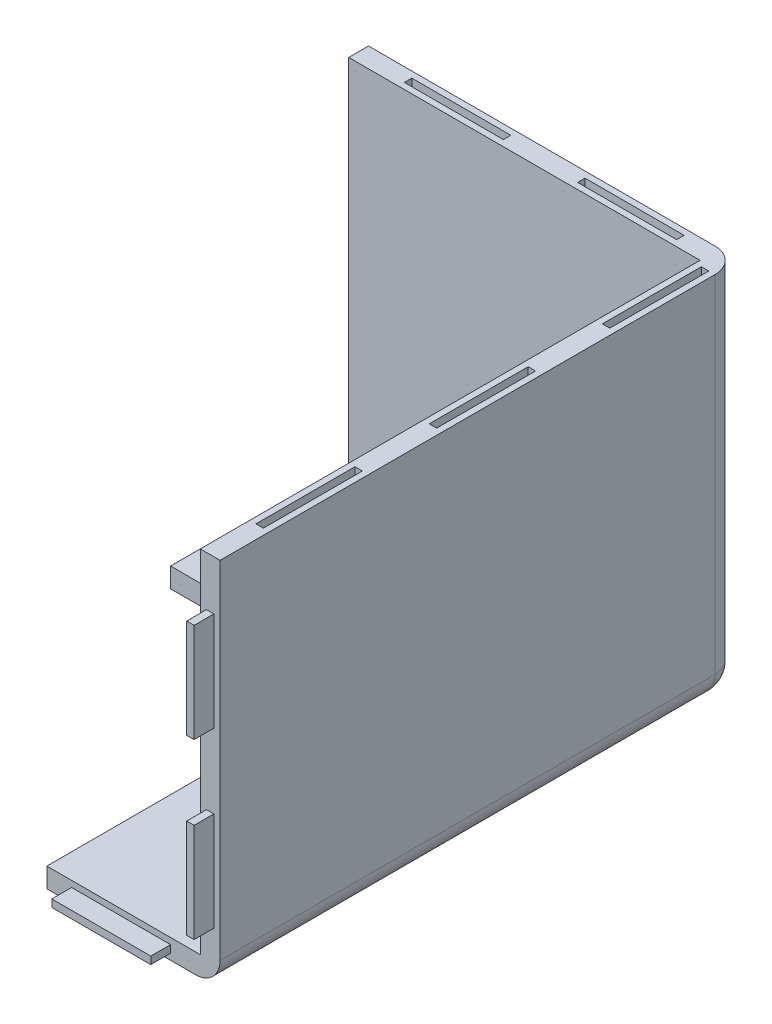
ISO-10303-21;
HEADER;
FILE_DESCRIPTION(('STEP AP214'),'2;1');
FILE_NAME('part.step','',(''),(''),'','','');
FILE_SCHEMA(('AUTOMOTIVE_DESIGN { 1 0 10303 214 1 1 1 1 }'));
ENDSEC;
DATA;
#1=APPLICATION_CONTEXT('core data for automotive mechanical design processes');
#2=APPLICATION_PROTOCOL_DEFINITION('international standard','automotive_design',2000,#1);
#3=PRODUCT_CONTEXT('',#1,'mechanical');
#4=PRODUCT('Part','Part','',(#3));
#5=PRODUCT_RELATED_PRODUCT_CATEGORY('part','',(#4));
#6=PRODUCT_DEFINITION_FORMATION('','',#4);
#7=PRODUCT_DEFINITION_CONTEXT('part definition',#1,'design');
#8=PRODUCT_DEFINITION('design','',#6,#7);
#9=PRODUCT_DEFINITION_SHAPE('','',#8);
#10=(LENGTH_UNIT() NAMED_UNIT(*) SI_UNIT(.MILLI.,.METRE.));
#11=(NAMED_UNIT(*) PLANE_ANGLE_UNIT() SI_UNIT($,.RADIAN.));
#12=(NAMED_UNIT(*) SI_UNIT($,.STERADIAN.) SOLID_ANGLE_UNIT());
#13=UNCERTAINTY_MEASURE_WITH_UNIT(LENGTH_MEASURE(1.E-05),#10,'distance_accuracy_value','');
#14=(GEOMETRIC_REPRESENTATION_CONTEXT(3) GLOBAL_UNCERTAINTY_ASSIGNED_CONTEXT((#13)) GLOBAL_UNIT_ASSIGNED_CONTEXT((#10,
#11,#12)) REPRESENTATION_CONTEXT('',''));
#15=CARTESIAN_POINT('',(0.,0.,0.));
#16=DIRECTION('',(0.,0.,1.));
#17=DIRECTION('',(1.,0.,0.));
#18=AXIS2_PLACEMENT_3D('',#15,#16,#17);
#19=CARTESIAN_POINT('',(0.,150.,0.));
#20=DIRECTION('',(0.,0.,-1.));
#21=DIRECTION('',(-1.,0.,0.));
#22=AXIS2_PLACEMENT_3D('',#19,#20,#21);
#23=PLANE('',#22);
#24=DIRECTION('',(0.,-1.,0.));
#25=VECTOR('',#24,1.);
#26=CARTESIAN_POINT('',(144.5,130.,0.));
#27=LINE('',#26,#25);
#28=CARTESIAN_POINT('',(144.5,130.,0.));
#29=VERTEX_POINT('',#28);
#30=CARTESIAN_POINT('',(144.5,90.,0.));
#31=VERTEX_POINT('',#30);
#32=EDGE_CURVE('E720',#29,#31,#27,.T.);
#33=ORIENTED_EDGE('',*,*,#32,.F.);
#34=DIRECTION('',(-1.,0.,0.));
#35=VECTOR('',#34,1.);
#36=CARTESIAN_POINT('',(144.5,130.,0.));
#37=LINE('',#36,#35);
#38=CARTESIAN_POINT('',(147.5,130.,0.));
#39=VERTEX_POINT('',#38);
#40=EDGE_CURVE('E737',#39,#29,#37,.T.);
#41=ORIENTED_EDGE('',*,*,#40,.F.);
#42=DIRECTION('',(0.,1.,0.));
#43=VECTOR('',#42,1.);
#44=CARTESIAN_POINT('',(147.5,130.,0.));
#45=LINE('',#44,#43);
#46=CARTESIAN_POINT('',(147.5,90.,0.));
#47=VERTEX_POINT('',#46);
#48=EDGE_CURVE('E754',#47,#39,#45,.T.);
#49=ORIENTED_EDGE('',*,*,#48,.F.);
#50=DIRECTION('',(1.,0.,0.));
#51=VECTOR('',#50,1.);
#52=CARTESIAN_POINT('',(144.5,90.,0.));
#53=LINE('',#52,#51);
#54=EDGE_CURVE('E750',#31,#47,#53,.T.);
#55=ORIENTED_EDGE('',*,*,#54,.F.);
#56=EDGE_LOOP('',(#33,#41,#49,#55));
#57=FACE_BOUND('',#56,.T.);
#58=DIRECTION('',(1.,0.,0.));
#59=VECTOR('',#58,1.);
#60=CARTESIAN_POINT('',(0.,8.00000000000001,0.));
#61=LINE('',#60,#59);
#62=CARTESIAN_POINT('',(80.,8.00000000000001,0.));
#63=VERTEX_POINT('',#62);
#64=CARTESIAN_POINT('',(142.,8.00000000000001,0.));
#65=VERTEX_POINT('',#64);
#66=EDGE_CURVE('E916',#63,#65,#61,.T.);
#67=ORIENTED_EDGE('',*,*,#66,.F.);
#68=DIRECTION('',(0.,-1.,0.));
#69=VECTOR('',#68,1.);
#70=CARTESIAN_POINT('',(80.,150.,0.));
#71=LINE('',#70,#69);
#72=CARTESIAN_POINT('',(80.,0.,0.));
#73=VERTEX_POINT('',#72);
#74=EDGE_CURVE('E635',#63,#73,#71,.T.);
#75=ORIENTED_EDGE('',*,*,#74,.T.);
#76=DIRECTION('',(1.,0.,0.));
#77=VECTOR('',#76,1.);
#78=CARTESIAN_POINT('',(0.,0.,0.));
#79=LINE('',#78,#77);
#80=CARTESIAN_POINT('',(140.,0.,0.));
#81=VERTEX_POINT('',#80);
#82=EDGE_CURVE('E949',#73,#81,#79,.T.);
#83=ORIENTED_EDGE('',*,*,#82,.T.);
#84=CARTESIAN_POINT('',(140.,10.,0.));
#85=DIRECTION('',(0.,0.,-1.));
#86=DIRECTION('',(-1.,0.,0.));
#87=AXIS2_PLACEMENT_3D('',#84,#85,#86);
#88=CIRCLE('',#87,10.);
#89=CARTESIAN_POINT('',(150.,10.,0.));
#90=VERTEX_POINT('',#89);
#91=EDGE_CURVE('E995',#81,#90,#88,.F.);
#92=ORIENTED_EDGE('',*,*,#91,.T.);
#93=DIRECTION('',(0.,-1.,0.));
#94=VECTOR('',#93,1.);
#95=CARTESIAN_POINT('',(150.,150.,0.));
#96=LINE('',#95,#94);
#97=CARTESIAN_POINT('',(150.,150.,0.));
#98=VERTEX_POINT('',#97);
#99=EDGE_CURVE('E968',#98,#90,#96,.T.);
#100=ORIENTED_EDGE('',*,*,#99,.F.);
#101=DIRECTION('',(1.,0.,0.));
#102=VECTOR('',#101,1.);
#103=CARTESIAN_POINT('',(0.,150.,0.));
#104=LINE('',#103,#102);
#105=CARTESIAN_POINT('',(142.,150.,0.));
#106=VERTEX_POINT('',#105);
#107=EDGE_CURVE('E948',#106,#98,#104,.T.);
#108=ORIENTED_EDGE('',*,*,#107,.F.);
#109=DIRECTION('',(0.,1.,0.));
#110=VECTOR('',#109,1.);
#111=CARTESIAN_POINT('',(142.,8.00000000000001,0.));
#112=LINE('',#111,#110);
#113=EDGE_CURVE('E928',#65,#106,#112,.T.);
#114=ORIENTED_EDGE('',*,*,#113,.F.);
#115=EDGE_LOOP('',(#67,#75,#83,#92,#100,#108,#114));
#116=FACE_BOUND('',#115,.T.);
#117=DIRECTION('',(0.,-1.,0.));
#118=VECTOR('',#117,1.);
#119=CARTESIAN_POINT('',(144.5,60.,0.));
#120=LINE('',#119,#118);
#121=CARTESIAN_POINT('',(144.5,60.,0.));
#122=VERTEX_POINT('',#121);
#123=CARTESIAN_POINT('',(144.5,20.,0.));
#124=VERTEX_POINT('',#123);
#125=EDGE_CURVE('E716',#122,#124,#120,.T.);
#126=ORIENTED_EDGE('',*,*,#125,.F.);
#127=DIRECTION('',(-1.,0.,0.));
#128=VECTOR('',#127,1.);
#129=CARTESIAN_POINT('',(144.5,60.,0.));
#130=LINE('',#129,#128);
#131=CARTESIAN_POINT('',(147.5,60.,0.));
#132=VERTEX_POINT('',#131);
#133=EDGE_CURVE('E703',#132,#122,#130,.T.);
#134=ORIENTED_EDGE('',*,*,#133,.F.);
#135=DIRECTION('',(0.,1.,0.));
#136=VECTOR('',#135,1.);
#137=CARTESIAN_POINT('',(147.5,60.,0.));
#138=LINE('',#137,#136);
#139=CARTESIAN_POINT('',(147.5,20.,0.));
#140=VERTEX_POINT('',#139);
#141=EDGE_CURVE('E707',#140,#132,#138,.T.);
#142=ORIENTED_EDGE('',*,*,#141,.F.);
#143=DIRECTION('',(1.,0.,0.));
#144=VECTOR('',#143,1.);
#145=CARTESIAN_POINT('',(144.5,20.,0.));
#146=LINE('',#145,#144);
#147=EDGE_CURVE('E712',#124,#140,#146,.T.);
#148=ORIENTED_EDGE('',*,*,#147,.F.);
#149=EDGE_LOOP('',(#126,#134,#142,#148));
#150=FACE_BOUND('',#149,.T.);
#151=DIRECTION('',(0.,-1.,0.));
#152=VECTOR('',#151,1.);
#153=CARTESIAN_POINT('',(90.,5.50000000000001,0.));
#154=LINE('',#153,#152);
#155=CARTESIAN_POINT('',(90.,5.50000000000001,0.));
#156=VERTEX_POINT('',#155);
#157=CARTESIAN_POINT('',(90.,2.5,0.));
#158=VERTEX_POINT('',#157);
#159=EDGE_CURVE('E671',#156,#158,#154,.T.);
#160=ORIENTED_EDGE('',*,*,#159,.F.);
#161=DIRECTION('',(-1.,0.,0.));
#162=VECTOR('',#161,1.);
#163=CARTESIAN_POINT('',(90.,5.50000000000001,0.));
#164=LINE('',#163,#162);
#165=CARTESIAN_POINT('',(130.,5.50000000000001,0.));
#166=VERTEX_POINT('',#165);
#167=EDGE_CURVE('E658',#166,#156,#164,.T.);
#168=ORIENTED_EDGE('',*,*,#167,.F.);
#169=DIRECTION('',(0.,1.,0.));
#170=VECTOR('',#169,1.);
#171=CARTESIAN_POINT('',(130.,5.50000000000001,0.));
#172=LINE('',#171,#170);
#173=CARTESIAN_POINT('',(130.,2.5,0.));
#174=VERTEX_POINT('',#173);
#175=EDGE_CURVE('E662',#174,#166,#172,.T.);
#176=ORIENTED_EDGE('',*,*,#175,.F.);
#177=DIRECTION('',(1.,0.,0.));
#178=VECTOR('',#177,1.);
#179=CARTESIAN_POINT('',(90.,2.50000000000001,0.));
#180=LINE('',#179,#178);
#181=EDGE_CURVE('E667',#158,#174,#180,.T.);
#182=ORIENTED_EDGE('',*,*,#181,.F.);
#183=EDGE_LOOP('',(#160,#168,#176,#182));
#184=FACE_BOUND('',#183,.T.);
#185=ADVANCED_FACE('F47',(#57,#116,#150,#184),#23,.F.);
#186=CARTESIAN_POINT('',(0.,150.,0.));
#187=DIRECTION('',(1.,0.,0.));
#188=DIRECTION('',(0.,0.,-1.));
#189=AXIS2_PLACEMENT_3D('',#186,#187,#188);
#190=PLANE('',#189);
#191=DIRECTION('',(0.,0.,1.));
#192=VECTOR('',#191,1.);
#193=CARTESIAN_POINT('',(0.,90.,-207.5));
#194=LINE('',#193,#192);
#195=CARTESIAN_POINT('',(0.,90.,-207.5));
#196=VERTEX_POINT('',#195);
#197=CARTESIAN_POINT('',(0.,90.,-204.5));
#198=VERTEX_POINT('',#197);
#199=EDGE_CURVE('E798',#196,#198,#194,.T.);
#200=ORIENTED_EDGE('',*,*,#199,.F.);
#201=DIRECTION('',(0.,-1.,0.));
#202=VECTOR('',#201,1.);
#203=CARTESIAN_POINT('',(0.,130.,-207.5));
#204=LINE('',#203,#202);
#205=CARTESIAN_POINT('',(0.,130.,-207.5));
#206=VERTEX_POINT('',#205);
#207=EDGE_CURVE('E795',#206,#196,#204,.T.);
#208=ORIENTED_EDGE('',*,*,#207,.F.);
#209=DIRECTION('',(0.,0.,-1.));
#210=VECTOR('',#209,1.);
#211=CARTESIAN_POINT('',(0.,130.,-207.5));
#212=LINE('',#211,#210);
#213=CARTESIAN_POINT('',(0.,130.,-204.5));
#214=VERTEX_POINT('',#213);
#215=EDGE_CURVE('E782',#214,#206,#212,.T.);
#216=ORIENTED_EDGE('',*,*,#215,.F.);
#217=DIRECTION('',(0.,1.,0.));
#218=VECTOR('',#217,1.);
#219=CARTESIAN_POINT('',(0.,130.,-204.5));
#220=LINE('',#219,#218);
#221=EDGE_CURVE('E803',#198,#214,#220,.T.);
#222=ORIENTED_EDGE('',*,*,#221,.F.);
#223=EDGE_LOOP('',(#200,#208,#216,#222));
#224=FACE_BOUND('',#223,.T.);
#225=DIRECTION('',(0.,0.,-1.));
#226=VECTOR('',#225,1.);
#227=CARTESIAN_POINT('',(0.,5.5,-160.));
#228=LINE('',#227,#226);
#229=CARTESIAN_POINT('',(0.,5.50000000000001,-160.));
#230=VERTEX_POINT('',#229);
#231=CARTESIAN_POINT('',(0.,5.49999999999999,-200.));
#232=VERTEX_POINT('',#231);
#233=EDGE_CURVE('E850',#230,#232,#228,.T.);
#234=ORIENTED_EDGE('',*,*,#233,.F.);
#235=DIRECTION('',(0.,1.,0.));
#236=VECTOR('',#235,1.);
#237=CARTESIAN_POINT('',(0.,5.5,-160.));
#238=LINE('',#237,#236);
#239=CARTESIAN_POINT('',(0.,2.5,-160.));
#240=VERTEX_POINT('',#239);
#241=EDGE_CURVE('E827',#240,#230,#238,.T.);
#242=ORIENTED_EDGE('',*,*,#241,.F.);
#243=DIRECTION('',(0.,0.,1.));
#244=VECTOR('',#243,1.);
#245=CARTESIAN_POINT('',(0.,2.5,-160.));
#246=LINE('',#245,#244);
#247=CARTESIAN_POINT('',(0.,2.49999999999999,-200.));
#248=VERTEX_POINT('',#247);
#249=EDGE_CURVE('E841',#248,#240,#246,.T.);
#250=ORIENTED_EDGE('',*,*,#249,.F.);
#251=DIRECTION('',(0.,-1.,0.));
#252=VECTOR('',#251,1.);
#253=CARTESIAN_POINT('',(0.,5.49999999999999,-200.));
#254=LINE('',#253,#252);
#255=EDGE_CURVE('E845',#232,#248,#254,.T.);
#256=ORIENTED_EDGE('',*,*,#255,.F.);
#257=EDGE_LOOP('',(#234,#242,#250,#256));
#258=FACE_BOUND('',#257,.T.);
#259=DIRECTION('',(0.,0.,1.));
#260=VECTOR('',#259,1.);
#261=CARTESIAN_POINT('',(0.,0.,0.));
#262=LINE('',#261,#260);
#263=CARTESIAN_POINT('',(0.,0.,-200.));
#264=VERTEX_POINT('',#263);
#265=CARTESIAN_POINT('',(0.,0.,-130.));
#266=VERTEX_POINT('',#265);
#267=EDGE_CURVE('E938',#264,#266,#262,.T.);
#268=ORIENTED_EDGE('',*,*,#267,.T.);
#269=DIRECTION('',(0.,-1.,0.));
#270=VECTOR('',#269,1.);
#271=CARTESIAN_POINT('',(0.,5.5,-130.));
#272=LINE('',#271,#270);
#273=CARTESIAN_POINT('',(0.,8.00000000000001,-130.));
#274=VERTEX_POINT('',#273);
#275=EDGE_CURVE('E823',#274,#266,#272,.T.);
#276=ORIENTED_EDGE('',*,*,#275,.F.);
#277=DIRECTION('',(0.,0.,1.));
#278=VECTOR('',#277,1.);
#279=CARTESIAN_POINT('',(0.,8.00000000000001,-202.));
#280=LINE('',#279,#278);
#281=CARTESIAN_POINT('',(0.,8.00000000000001,-202.));
#282=VERTEX_POINT('',#281);
#283=EDGE_CURVE('E912',#282,#274,#280,.T.);
#284=ORIENTED_EDGE('',*,*,#283,.F.);
#285=DIRECTION('',(0.,1.,0.));
#286=VECTOR('',#285,1.);
#287=CARTESIAN_POINT('',(0.,8.00000000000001,-202.));
#288=LINE('',#287,#286);
#289=CARTESIAN_POINT('',(0.,150.,-202.));
#290=VERTEX_POINT('',#289);
#291=EDGE_CURVE('E934',#282,#290,#288,.T.);
#292=ORIENTED_EDGE('',*,*,#291,.T.);
#293=DIRECTION('',(0.,0.,1.));
#294=VECTOR('',#293,1.);
#295=CARTESIAN_POINT('',(0.,150.,0.));
#296=LINE('',#295,#294);
#297=CARTESIAN_POINT('',(0.,150.,-210.));
#298=VERTEX_POINT('',#297);
#299=EDGE_CURVE('E944',#298,#290,#296,.T.);
#300=ORIENTED_EDGE('',*,*,#299,.F.);
#301=DIRECTION('',(0.,-1.,0.));
#302=VECTOR('',#301,1.);
#303=CARTESIAN_POINT('',(0.,150.,-210.));
#304=LINE('',#303,#302);
#305=CARTESIAN_POINT('',(0.,10.,-210.));
#306=VERTEX_POINT('',#305);
#307=EDGE_CURVE('E959',#298,#306,#304,.T.);
#308=ORIENTED_EDGE('',*,*,#307,.T.);
#309=CARTESIAN_POINT('',(0.,10.,-200.));
#310=DIRECTION('',(1.,0.,0.));
#311=DIRECTION('',(0.,0.,-1.));
#312=AXIS2_PLACEMENT_3D('',#309,#310,#311);
#313=CIRCLE('',#312,10.);
#314=EDGE_CURVE('E979',#306,#264,#313,.F.);
#315=ORIENTED_EDGE('',*,*,#314,.T.);
#316=EDGE_LOOP('',(#268,#276,#284,#292,#300,#308,#315));
#317=FACE_BOUND('',#316,.T.);
#318=DIRECTION('',(0.,0.,1.));
#319=VECTOR('',#318,1.);
#320=CARTESIAN_POINT('',(0.,20.,-207.5));
#321=LINE('',#320,#319);
#322=CARTESIAN_POINT('',(0.,20.,-207.5));
#323=VERTEX_POINT('',#322);
#324=CARTESIAN_POINT('',(0.,20.,-204.5));
#325=VERTEX_POINT('',#324);
#326=EDGE_CURVE('E892',#323,#325,#321,.T.);
#327=ORIENTED_EDGE('',*,*,#326,.F.);
#328=DIRECTION('',(0.,-1.,0.));
#329=VECTOR('',#328,1.);
#330=CARTESIAN_POINT('',(0.,60.,-207.5));
#331=LINE('',#330,#329);
#332=CARTESIAN_POINT('',(0.,60.,-207.5));
#333=VERTEX_POINT('',#332);
#334=EDGE_CURVE('E799',#333,#323,#331,.T.);
#335=ORIENTED_EDGE('',*,*,#334,.F.);
#336=DIRECTION('',(0.,0.,-1.));
#337=VECTOR('',#336,1.);
#338=CARTESIAN_POINT('',(0.,60.,-207.5));
#339=LINE('',#338,#337);
#340=CARTESIAN_POINT('',(0.,60.,-204.5));
#341=VERTEX_POINT('',#340);
#342=EDGE_CURVE('E883',#341,#333,#339,.T.);
#343=ORIENTED_EDGE('',*,*,#342,.F.);
#344=DIRECTION('',(0.,1.,0.));
#345=VECTOR('',#344,1.);
#346=CARTESIAN_POINT('',(0.,60.,-204.5));
#347=LINE('',#346,#345);
#348=EDGE_CURVE('E887',#325,#341,#347,.T.);
#349=ORIENTED_EDGE('',*,*,#348,.F.);
#350=EDGE_LOOP('',(#327,#335,#343,#349));
#351=FACE_BOUND('',#350,.T.);
#352=ADVANCED_FACE('F1027',(#224,#258,#317,#351),#190,.F.);
#353=CARTESIAN_POINT('',(150.,150.,0.));
#354=DIRECTION('',(-1.,0.,0.));
#355=DIRECTION('',(0.,0.,1.));
#356=AXIS2_PLACEMENT_3D('',#353,#354,#355);
#357=PLANE('',#356);
#358=ORIENTED_EDGE('',*,*,#99,.T.);
#359=DIRECTION('',(0.,0.,-1.));
#360=VECTOR('',#359,1.);
#361=CARTESIAN_POINT('',(150.,10.,-210.));
#362=LINE('',#361,#360);
#363=CARTESIAN_POINT('',(150.,10.,-200.));
#364=VERTEX_POINT('',#363);
#365=EDGE_CURVE('E992',#90,#364,#362,.T.);
#366=ORIENTED_EDGE('',*,*,#365,.T.);
#367=DIRECTION('',(0.,-1.,0.));
#368=VECTOR('',#367,1.);
#369=CARTESIAN_POINT('',(150.,150.,-200.));
#370=LINE('',#369,#368);
#371=CARTESIAN_POINT('',(150.,150.,-200.));
#372=VERTEX_POINT('',#371);
#373=EDGE_CURVE('E989',#364,#372,#370,.F.);
#374=ORIENTED_EDGE('',*,*,#373,.T.);
#375=DIRECTION('',(0.,0.,-1.));
#376=VECTOR('',#375,1.);
#377=CARTESIAN_POINT('',(150.,150.,0.));
#378=LINE('',#377,#376);
#379=EDGE_CURVE('E952',#98,#372,#378,.T.);
#380=ORIENTED_EDGE('',*,*,#379,.F.);
#381=EDGE_LOOP('',(#358,#366,#374,#380));
#382=FACE_BOUND('',#381,.T.);
#383=ADVANCED_FACE('F1041',(#382),#357,.F.);
#384=CARTESIAN_POINT('',(0.,150.,-210.));
#385=DIRECTION('',(0.,0.,1.));
#386=DIRECTION('',(1.,0.,0.));
#387=AXIS2_PLACEMENT_3D('',#384,#385,#386);
#388=PLANE('',#387);
#389=DIRECTION('',(0.,-1.,0.));
#390=VECTOR('',#389,1.);
#391=CARTESIAN_POINT('',(140.,150.,-210.));
#392=LINE('',#391,#390);
#393=CARTESIAN_POINT('',(140.,150.,-210.));
#394=VERTEX_POINT('',#393);
#395=CARTESIAN_POINT('',(140.,10.,-210.));
#396=VERTEX_POINT('',#395);
#397=EDGE_CURVE('E972',#394,#396,#392,.T.);
#398=ORIENTED_EDGE('',*,*,#397,.T.);
#399=DIRECTION('',(-1.,0.,0.));
#400=VECTOR('',#399,1.);
#401=CARTESIAN_POINT('',(0.,10.,-210.));
#402=LINE('',#401,#400);
#403=EDGE_CURVE('E975',#396,#306,#402,.T.);
#404=ORIENTED_EDGE('',*,*,#403,.T.);
#405=ORIENTED_EDGE('',*,*,#307,.F.);
#406=DIRECTION('',(-1.,0.,0.));
#407=VECTOR('',#406,1.);
#408=CARTESIAN_POINT('',(0.,150.,-210.));
#409=LINE('',#408,#407);
#410=EDGE_CURVE('E956',#394,#298,#409,.T.);
#411=ORIENTED_EDGE('',*,*,#410,.F.);
#412=EDGE_LOOP('',(#398,#404,#405,#411));
#413=FACE_BOUND('',#412,.T.);
#414=ADVANCED_FACE('F1022',(#413),#388,.F.);
#415=CARTESIAN_POINT('',(0.,150.,0.));
#416=DIRECTION('',(0.,-1.,0.));
#417=DIRECTION('',(0.,0.,-1.));
#418=AXIS2_PLACEMENT_3D('',#415,#416,#417);
#419=PLANE('',#418);
#420=DIRECTION('',(1.,0.,0.));
#421=VECTOR('',#420,1.);
#422=CARTESIAN_POINT('',(20.,150.,-204.5));
#423=LINE('',#422,#421);
#424=CARTESIAN_POINT('',(20.,150.,-204.5));
#425=VERTEX_POINT('',#424);
#426=CARTESIAN_POINT('',(60.,150.,-204.5));
#427=VERTEX_POINT('',#426);
#428=EDGE_CURVE('E433',#425,#427,#423,.T.);
#429=ORIENTED_EDGE('',*,*,#428,.F.);
#430=DIRECTION('',(0.,0.,1.));
#431=VECTOR('',#430,1.);
#432=CARTESIAN_POINT('',(20.,150.,-207.5));
#433=LINE('',#432,#431);
#434=CARTESIAN_POINT('',(20.,150.,-207.5));
#435=VERTEX_POINT('',#434);
#436=EDGE_CURVE('E63',#435,#425,#433,.T.);
#437=ORIENTED_EDGE('',*,*,#436,.F.);
#438=DIRECTION('',(-1.,0.,0.));
#439=VECTOR('',#438,1.);
#440=CARTESIAN_POINT('',(20.,150.,-207.5));
#441=LINE('',#440,#439);
#442=CARTESIAN_POINT('',(60.,150.,-207.5));
#443=VERTEX_POINT('',#442);
#444=EDGE_CURVE('E420',#443,#435,#441,.T.);
#445=ORIENTED_EDGE('',*,*,#444,.F.);
#446=DIRECTION('',(0.,0.,-1.));
#447=VECTOR('',#446,1.);
#448=CARTESIAN_POINT('',(60.,150.,-207.5));
#449=LINE('',#448,#447);
#450=EDGE_CURVE('E424',#427,#443,#449,.T.);
#451=ORIENTED_EDGE('',*,*,#450,.F.);
#452=EDGE_LOOP('',(#429,#437,#445,#451));
#453=FACE_BOUND('',#452,.T.);
#454=DIRECTION('',(1.,0.,0.));
#455=VECTOR('',#454,1.);
#456=CARTESIAN_POINT('',(144.5,150.,-160.));
#457=LINE('',#456,#455);
#458=CARTESIAN_POINT('',(144.5,150.,-160.));
#459=VERTEX_POINT('',#458);
#460=CARTESIAN_POINT('',(147.5,150.,-160.));
#461=VERTEX_POINT('',#460);
#462=EDGE_CURVE('E516',#459,#461,#457,.T.);
#463=ORIENTED_EDGE('',*,*,#462,.F.);
#464=DIRECTION('',(0.,0.,1.));
#465=VECTOR('',#464,1.);
#466=CARTESIAN_POINT('',(144.5,150.,-160.));
#467=LINE('',#466,#465);
#468=CARTESIAN_POINT('',(144.5,150.,-200.));
#469=VERTEX_POINT('',#468);
#470=EDGE_CURVE('E71',#469,#459,#467,.T.);
#471=ORIENTED_EDGE('',*,*,#470,.F.);
#472=DIRECTION('',(-1.,0.,0.));
#473=VECTOR('',#472,1.);
#474=CARTESIAN_POINT('',(144.5,150.,-200.));
#475=LINE('',#474,#473);
#476=CARTESIAN_POINT('',(147.5,150.,-200.));
#477=VERTEX_POINT('',#476);
#478=EDGE_CURVE('E507',#477,#469,#475,.T.);
#479=ORIENTED_EDGE('',*,*,#478,.F.);
#480=DIRECTION('',(0.,0.,-1.));
#481=VECTOR('',#480,1.);
#482=CARTESIAN_POINT('',(147.5,150.,-160.));
#483=LINE('',#482,#481);
#484=EDGE_CURVE('E511',#461,#477,#483,.T.);
#485=ORIENTED_EDGE('',*,*,#484,.F.);
#486=EDGE_LOOP('',(#463,#471,#479,#485));
#487=FACE_BOUND('',#486,.T.);
#488=DIRECTION('',(1.,0.,0.));
#489=VECTOR('',#488,1.);
#490=CARTESIAN_POINT('',(144.5,150.,-90.));
#491=LINE('',#490,#489);
#492=CARTESIAN_POINT('',(144.5,150.,-90.));
#493=VERTEX_POINT('',#492);
#494=CARTESIAN_POINT('',(147.5,150.,-90.));
#495=VERTEX_POINT('',#494);
#496=EDGE_CURVE('E472',#493,#495,#491,.T.);
#497=ORIENTED_EDGE('',*,*,#496,.F.);
#498=DIRECTION('',(0.,0.,1.));
#499=VECTOR('',#498,1.);
#500=CARTESIAN_POINT('',(144.5,150.,-90.));
#501=LINE('',#500,#499);
#502=CARTESIAN_POINT('',(144.5,150.,-130.));
#503=VERTEX_POINT('',#502);
#504=EDGE_CURVE('E476',#503,#493,#501,.T.);
#505=ORIENTED_EDGE('',*,*,#504,.F.);
#506=DIRECTION('',(-1.,0.,0.));
#507=VECTOR('',#506,1.);
#508=CARTESIAN_POINT('',(144.5,150.,-130.));
#509=LINE('',#508,#507);
#510=CARTESIAN_POINT('',(147.5,150.,-130.));
#511=VERTEX_POINT('',#510);
#512=EDGE_CURVE('E463',#511,#503,#509,.T.);
#513=ORIENTED_EDGE('',*,*,#512,.F.);
#514=DIRECTION('',(0.,0.,-1.));
#515=VECTOR('',#514,1.);
#516=CARTESIAN_POINT('',(147.5,150.,-90.));
#517=LINE('',#516,#515);
#518=EDGE_CURVE('E467',#495,#511,#517,.T.);
#519=ORIENTED_EDGE('',*,*,#518,.F.);
#520=EDGE_LOOP('',(#497,#505,#513,#519));
#521=FACE_BOUND('',#520,.T.);
#522=DIRECTION('',(1.,0.,0.));
#523=VECTOR('',#522,1.);
#524=CARTESIAN_POINT('',(144.5,150.,-20.));
#525=LINE('',#524,#523);
#526=CARTESIAN_POINT('',(144.5,150.,-20.));
#527=VERTEX_POINT('',#526);
#528=CARTESIAN_POINT('',(147.5,150.,-20.));
#529=VERTEX_POINT('',#528);
#530=EDGE_CURVE('E602',#527,#529,#525,.T.);
#531=ORIENTED_EDGE('',*,*,#530,.F.);
#532=DIRECTION('',(0.,0.,1.));
#533=VECTOR('',#532,1.);
#534=CARTESIAN_POINT('',(144.5,150.,-20.));
#535=LINE('',#534,#533);
#536=CARTESIAN_POINT('',(144.5,150.,-60.));
#537=VERTEX_POINT('',#536);
#538=EDGE_CURVE('E550',#537,#527,#535,.T.);
#539=ORIENTED_EDGE('',*,*,#538,.F.);
#540=DIRECTION('',(-1.,0.,0.));
#541=VECTOR('',#540,1.);
#542=CARTESIAN_POINT('',(144.5,150.,-60.));
#543=LINE('',#542,#541);
#544=CARTESIAN_POINT('',(147.5,150.,-60.));
#545=VERTEX_POINT('',#544);
#546=EDGE_CURVE('E593',#545,#537,#543,.T.);
#547=ORIENTED_EDGE('',*,*,#546,.F.);
#548=DIRECTION('',(0.,0.,-1.));
#549=VECTOR('',#548,1.);
#550=CARTESIAN_POINT('',(147.5,150.,-20.));
#551=LINE('',#550,#549);
#552=EDGE_CURVE('E597',#529,#545,#551,.T.);
#553=ORIENTED_EDGE('',*,*,#552,.F.);
#554=EDGE_LOOP('',(#531,#539,#547,#553));
#555=FACE_BOUND('',#554,.T.);
#556=DIRECTION('',(1.,0.,0.));
#557=VECTOR('',#556,1.);
#558=CARTESIAN_POINT('',(90.,150.,-204.5));
#559=LINE('',#558,#557);
#560=CARTESIAN_POINT('',(90.,150.,-204.5));
#561=VERTEX_POINT('',#560);
#562=CARTESIAN_POINT('',(130.,150.,-204.5));
#563=VERTEX_POINT('',#562);
#564=EDGE_CURVE('E560',#561,#563,#559,.T.);
#565=ORIENTED_EDGE('',*,*,#564,.F.);
#566=DIRECTION('',(0.,0.,1.));
#567=VECTOR('',#566,1.);
#568=CARTESIAN_POINT('',(90.,150.,-207.5));
#569=LINE('',#568,#567);
#570=CARTESIAN_POINT('',(90.,150.,-207.5));
#571=VERTEX_POINT('',#570);
#572=EDGE_CURVE('E434',#571,#561,#569,.T.);
#573=ORIENTED_EDGE('',*,*,#572,.F.);
#574=DIRECTION('',(-1.,0.,0.));
#575=VECTOR('',#574,1.);
#576=CARTESIAN_POINT('',(90.,150.,-207.5));
#577=LINE('',#576,#575);
#578=CARTESIAN_POINT('',(130.,150.,-207.5));
#579=VERTEX_POINT('',#578);
#580=EDGE_CURVE('E551',#579,#571,#577,.T.);
#581=ORIENTED_EDGE('',*,*,#580,.F.);
#582=DIRECTION('',(0.,0.,-1.));
#583=VECTOR('',#582,1.);
#584=CARTESIAN_POINT('',(130.,150.,-207.5));
#585=LINE('',#584,#583);
#586=EDGE_CURVE('E555',#563,#579,#585,.T.);
#587=ORIENTED_EDGE('',*,*,#586,.F.);
#588=EDGE_LOOP('',(#565,#573,#581,#587));
#589=FACE_BOUND('',#588,.T.);
#590=ORIENTED_EDGE('',*,*,#379,.T.);
#591=CARTESIAN_POINT('',(140.,150.,-200.));
#592=DIRECTION('',(0.,-1.,0.));
#593=DIRECTION('',(0.,0.,-1.));
#594=AXIS2_PLACEMENT_3D('',#591,#592,#593);
#595=CIRCLE('',#594,10.);
#596=EDGE_CURVE('E56',#372,#394,#595,.F.);
#597=ORIENTED_EDGE('',*,*,#596,.T.);
#598=ORIENTED_EDGE('',*,*,#410,.T.);
#599=ORIENTED_EDGE('',*,*,#299,.T.);
#600=DIRECTION('',(-1.,0.,0.));
#601=VECTOR('',#600,1.);
#602=CARTESIAN_POINT('',(0.,150.,-202.));
#603=LINE('',#602,#601);
#604=CARTESIAN_POINT('',(142.,150.,-202.));
#605=VERTEX_POINT('',#604);
#606=EDGE_CURVE('E917',#605,#290,#603,.T.);
#607=ORIENTED_EDGE('',*,*,#606,.F.);
#608=DIRECTION('',(0.,0.,-1.));
#609=VECTOR('',#608,1.);
#610=CARTESIAN_POINT('',(142.,150.,-202.));
#611=LINE('',#610,#609);
#612=EDGE_CURVE('E813',#106,#605,#611,.T.);
#613=ORIENTED_EDGE('',*,*,#612,.F.);
#614=ORIENTED_EDGE('',*,*,#107,.T.);
#615=EDGE_LOOP('',(#590,#597,#598,#599,#607,#613,#614));
#616=FACE_BOUND('',#615,.T.);
#617=ADVANCED_FACE('F1033',(#453,#487,#521,#555,#589,#616),#419,.F.);
#618=CARTESIAN_POINT('',(0.,0.,0.));
#619=DIRECTION('',(0.,-1.,0.));
#620=DIRECTION('',(0.,0.,-1.));
#621=AXIS2_PLACEMENT_3D('',#618,#619,#620);
#622=PLANE('',#621);
#623=DIRECTION('',(0.,0.,1.));
#624=VECTOR('',#623,1.);
#625=CARTESIAN_POINT('',(80.,0.,8.));
#626=LINE('',#625,#624);
#627=CARTESIAN_POINT('',(80.,0.,-130.));
#628=VERTEX_POINT('',#627);
#629=EDGE_CURVE('E625',#628,#73,#626,.T.);
#630=ORIENTED_EDGE('',*,*,#629,.F.);
#631=DIRECTION('',(1.,0.,0.));
#632=VECTOR('',#631,1.);
#633=CARTESIAN_POINT('',(0.,0.,-130.));
#634=LINE('',#633,#632);
#635=EDGE_CURVE('E443',#266,#628,#634,.T.);
#636=ORIENTED_EDGE('',*,*,#635,.F.);
#637=ORIENTED_EDGE('',*,*,#267,.F.);
#638=DIRECTION('',(-1.,0.,0.));
#639=VECTOR('',#638,1.);
#640=CARTESIAN_POINT('',(150.,0.,-200.));
#641=LINE('',#640,#639);
#642=CARTESIAN_POINT('',(140.,0.,-200.));
#643=VERTEX_POINT('',#642);
#644=EDGE_CURVE('E986',#264,#643,#641,.F.);
#645=ORIENTED_EDGE('',*,*,#644,.T.);
#646=DIRECTION('',(0.,0.,-1.));
#647=VECTOR('',#646,1.);
#648=CARTESIAN_POINT('',(140.,0.,0.));
#649=LINE('',#648,#647);
#650=EDGE_CURVE('E982',#643,#81,#649,.F.);
#651=ORIENTED_EDGE('',*,*,#650,.T.);
#652=ORIENTED_EDGE('',*,*,#82,.F.);
#653=EDGE_LOOP('',(#630,#636,#637,#645,#651,#652));
#654=FACE_BOUND('',#653,.T.);
#655=ADVANCED_FACE('F1052',(#654),#622,.T.);
#656=CARTESIAN_POINT('',(0.,8.00000000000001,-202.));
#657=DIRECTION('',(0.,0.,-1.));
#658=DIRECTION('',(-1.,0.,0.));
#659=AXIS2_PLACEMENT_3D('',#656,#657,#658);
#660=PLANE('',#659);
#661=ORIENTED_EDGE('',*,*,#606,.T.);
#662=ORIENTED_EDGE('',*,*,#291,.F.);
#663=DIRECTION('',(-1.,0.,0.));
#664=VECTOR('',#663,1.);
#665=CARTESIAN_POINT('',(0.,8.00000000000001,-202.));
#666=LINE('',#665,#664);
#667=CARTESIAN_POINT('',(142.,8.00000000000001,-202.));
#668=VERTEX_POINT('',#667);
#669=EDGE_CURVE('E924',#668,#282,#666,.T.);
#670=ORIENTED_EDGE('',*,*,#669,.F.);
#671=DIRECTION('',(0.,1.,0.));
#672=VECTOR('',#671,1.);
#673=CARTESIAN_POINT('',(142.,8.00000000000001,-202.));
#674=LINE('',#673,#672);
#675=EDGE_CURVE('E939',#668,#605,#674,.T.);
#676=ORIENTED_EDGE('',*,*,#675,.T.);
#677=EDGE_LOOP('',(#661,#662,#670,#676));
#678=FACE_BOUND('',#677,.T.);
#679=ADVANCED_FACE('F1064',(#678),#660,.F.);
#680=CARTESIAN_POINT('',(142.,8.00000000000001,-202.));
#681=DIRECTION('',(1.,0.,0.));
#682=DIRECTION('',(0.,0.,-1.));
#683=AXIS2_PLACEMENT_3D('',#680,#681,#682);
#684=PLANE('',#683);
#685=ORIENTED_EDGE('',*,*,#612,.T.);
#686=ORIENTED_EDGE('',*,*,#675,.F.);
#687=DIRECTION('',(0.,0.,-1.));
#688=VECTOR('',#687,1.);
#689=CARTESIAN_POINT('',(142.,8.00000000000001,-202.));
#690=LINE('',#689,#688);
#691=EDGE_CURVE('E920',#65,#668,#690,.T.);
#692=ORIENTED_EDGE('',*,*,#691,.F.);
#693=ORIENTED_EDGE('',*,*,#113,.T.);
#694=EDGE_LOOP('',(#685,#686,#692,#693));
#695=FACE_BOUND('',#694,.T.);
#696=ADVANCED_FACE('F1066',(#695),#684,.F.);
#697=CARTESIAN_POINT('',(0.,8.00000000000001,0.));
#698=DIRECTION('',(0.,1.,0.));
#699=DIRECTION('',(0.,0.,1.));
#700=AXIS2_PLACEMENT_3D('',#697,#698,#699);
#701=PLANE('',#700);
#702=DIRECTION('',(0.,0.,-1.));
#703=VECTOR('',#702,1.);
#704=CARTESIAN_POINT('',(80.,8.00000000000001,0.));
#705=LINE('',#704,#703);
#706=CARTESIAN_POINT('',(80.,8.00000000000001,-130.));
#707=VERTEX_POINT('',#706);
#708=EDGE_CURVE('E11',#63,#707,#705,.T.);
#709=ORIENTED_EDGE('',*,*,#708,.F.);
#710=ORIENTED_EDGE('',*,*,#66,.T.);
#711=ORIENTED_EDGE('',*,*,#691,.T.);
#712=ORIENTED_EDGE('',*,*,#669,.T.);
#713=ORIENTED_EDGE('',*,*,#283,.T.);
#714=DIRECTION('',(-1.,0.,0.));
#715=VECTOR('',#714,1.);
#716=CARTESIAN_POINT('',(0.,8.00000000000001,-130.));
#717=LINE('',#716,#715);
#718=EDGE_CURVE('E631',#707,#274,#717,.T.);
#719=ORIENTED_EDGE('',*,*,#718,.F.);
#720=EDGE_LOOP('',(#709,#710,#711,#712,#713,#719));
#721=FACE_BOUND('',#720,.T.);
#722=ADVANCED_FACE('F1060',(#721),#701,.T.);
#723=CARTESIAN_POINT('',(8.,60.,-207.5));
#724=DIRECTION('',(0.,0.,-1.));
#725=DIRECTION('',(0.,1.,0.));
#726=AXIS2_PLACEMENT_3D('',#723,#724,#725);
#727=PLANE('',#726);
#728=ORIENTED_EDGE('',*,*,#334,.T.);
#729=DIRECTION('',(-1.,0.,0.));
#730=VECTOR('',#729,1.);
#731=CARTESIAN_POINT('',(8.,20.,-207.5));
#732=LINE('',#731,#730);
#733=CARTESIAN_POINT('',(8.,20.,-207.5));
#734=VERTEX_POINT('',#733);
#735=EDGE_CURVE('E870',#734,#323,#732,.T.);
#736=ORIENTED_EDGE('',*,*,#735,.F.);
#737=DIRECTION('',(0.,-1.,0.));
#738=VECTOR('',#737,1.);
#739=CARTESIAN_POINT('',(8.,60.,-207.5));
#740=LINE('',#739,#738);
#741=CARTESIAN_POINT('',(8.,60.,-207.5));
#742=VERTEX_POINT('',#741);
#743=EDGE_CURVE('E888',#742,#734,#740,.T.);
#744=ORIENTED_EDGE('',*,*,#743,.F.);
#745=DIRECTION('',(-1.,0.,0.));
#746=VECTOR('',#745,1.);
#747=CARTESIAN_POINT('',(8.,60.,-207.5));
#748=LINE('',#747,#746);
#749=EDGE_CURVE('E826',#742,#333,#748,.T.);
#750=ORIENTED_EDGE('',*,*,#749,.T.);
#751=EDGE_LOOP('',(#728,#736,#744,#750));
#752=FACE_BOUND('',#751,.T.);
#753=ADVANCED_FACE('F1200',(#752),#727,.F.);
#754=CARTESIAN_POINT('',(8.,60.,-207.5));
#755=DIRECTION('',(0.,1.,0.));
#756=DIRECTION('',(0.,0.,1.));
#757=AXIS2_PLACEMENT_3D('',#754,#755,#756);
#758=PLANE('',#757);
#759=ORIENTED_EDGE('',*,*,#342,.T.);
#760=ORIENTED_EDGE('',*,*,#749,.F.);
#761=DIRECTION('',(0.,0.,-1.));
#762=VECTOR('',#761,1.);
#763=CARTESIAN_POINT('',(8.,60.,-207.5));
#764=LINE('',#763,#762);
#765=CARTESIAN_POINT('',(8.,60.,-204.5));
#766=VERTEX_POINT('',#765);
#767=EDGE_CURVE('E874',#766,#742,#764,.T.);
#768=ORIENTED_EDGE('',*,*,#767,.F.);
#769=DIRECTION('',(-1.,0.,0.));
#770=VECTOR('',#769,1.);
#771=CARTESIAN_POINT('',(8.,60.,-204.5));
#772=LINE('',#771,#770);
#773=EDGE_CURVE('E878',#766,#341,#772,.T.);
#774=ORIENTED_EDGE('',*,*,#773,.T.);
#775=EDGE_LOOP('',(#759,#760,#768,#774));
#776=FACE_BOUND('',#775,.T.);
#777=ADVANCED_FACE('F1203',(#776),#758,.F.);
#778=CARTESIAN_POINT('',(8.,60.,-204.5));
#779=DIRECTION('',(0.,0.,1.));
#780=DIRECTION('',(1.,0.,0.));
#781=AXIS2_PLACEMENT_3D('',#778,#779,#780);
#782=PLANE('',#781);
#783=ORIENTED_EDGE('',*,*,#348,.T.);
#784=ORIENTED_EDGE('',*,*,#773,.F.);
#785=DIRECTION('',(0.,1.,0.));
#786=VECTOR('',#785,1.);
#787=CARTESIAN_POINT('',(8.,60.,-204.5));
#788=LINE('',#787,#786);
#789=CARTESIAN_POINT('',(8.,20.,-204.5));
#790=VERTEX_POINT('',#789);
#791=EDGE_CURVE('E901',#790,#766,#788,.T.);
#792=ORIENTED_EDGE('',*,*,#791,.F.);
#793=DIRECTION('',(-1.,0.,0.));
#794=VECTOR('',#793,1.);
#795=CARTESIAN_POINT('',(8.,20.,-204.5));
#796=LINE('',#795,#794);
#797=EDGE_CURVE('E875',#790,#325,#796,.T.);
#798=ORIENTED_EDGE('',*,*,#797,.T.);
#799=EDGE_LOOP('',(#783,#784,#792,#798));
#800=FACE_BOUND('',#799,.T.);
#801=ADVANCED_FACE('F1208',(#800),#782,.F.);
#802=CARTESIAN_POINT('',(8.,20.,-207.5));
#803=DIRECTION('',(0.,-1.,0.));
#804=DIRECTION('',(0.,0.,-1.));
#805=AXIS2_PLACEMENT_3D('',#802,#803,#804);
#806=PLANE('',#805);
#807=ORIENTED_EDGE('',*,*,#326,.T.);
#808=ORIENTED_EDGE('',*,*,#797,.F.);
#809=DIRECTION('',(0.,0.,1.));
#810=VECTOR('',#809,1.);
#811=CARTESIAN_POINT('',(8.,20.,-207.5));
#812=LINE('',#811,#810);
#813=EDGE_CURVE('E905',#734,#790,#812,.T.);
#814=ORIENTED_EDGE('',*,*,#813,.F.);
#815=ORIENTED_EDGE('',*,*,#735,.T.);
#816=EDGE_LOOP('',(#807,#808,#814,#815));
#817=FACE_BOUND('',#816,.T.);
#818=ADVANCED_FACE('F1205',(#817),#806,.F.);
#819=CARTESIAN_POINT('',(8.,0.,0.));
#820=DIRECTION('',(-1.,0.,0.));
#821=DIRECTION('',(0.,0.,1.));
#822=AXIS2_PLACEMENT_3D('',#819,#820,#821);
#823=PLANE('',#822);
#824=ORIENTED_EDGE('',*,*,#743,.T.);
#825=ORIENTED_EDGE('',*,*,#813,.T.);
#826=ORIENTED_EDGE('',*,*,#791,.T.);
#827=ORIENTED_EDGE('',*,*,#767,.T.);
#828=EDGE_LOOP('',(#824,#825,#826,#827));
#829=FACE_BOUND('',#828,.T.);
#830=ADVANCED_FACE('F1181',(#829),#823,.T.);
#831=CARTESIAN_POINT('',(8.,5.5,-130.));
#832=DIRECTION('',(0.,0.,-1.));
#833=DIRECTION('',(-1.,0.,0.));
#834=AXIS2_PLACEMENT_3D('',#831,#832,#833);
#835=PLANE('',#834);
#836=ORIENTED_EDGE('',*,*,#275,.T.);
#837=ORIENTED_EDGE('',*,*,#635,.T.);
#838=DIRECTION('',(0.,-1.,0.));
#839=VECTOR('',#838,1.);
#840=CARTESIAN_POINT('',(80.,10.,-130.));
#841=LINE('',#840,#839);
#842=EDGE_CURVE('E628',#707,#628,#841,.T.);
#843=ORIENTED_EDGE('',*,*,#842,.F.);
#844=ORIENTED_EDGE('',*,*,#718,.T.);
#845=EDGE_LOOP('',(#836,#837,#843,#844));
#846=FACE_BOUND('',#845,.T.);
#847=ADVANCED_FACE('F1057',(#846),#835,.F.);
#848=CARTESIAN_POINT('',(8.,5.5,-160.));
#849=DIRECTION('',(0.,0.,1.));
#850=DIRECTION('',(1.,0.,0.));
#851=AXIS2_PLACEMENT_3D('',#848,#849,#850);
#852=PLANE('',#851);
#853=ORIENTED_EDGE('',*,*,#241,.T.);
#854=DIRECTION('',(-1.,0.,0.));
#855=VECTOR('',#854,1.);
#856=CARTESIAN_POINT('',(8.,5.5,-160.));
#857=LINE('',#856,#855);
#858=CARTESIAN_POINT('',(8.,5.5,-160.));
#859=VERTEX_POINT('',#858);
#860=EDGE_CURVE('E828',#859,#230,#857,.T.);
#861=ORIENTED_EDGE('',*,*,#860,.F.);
#862=DIRECTION('',(0.,1.,0.));
#863=VECTOR('',#862,1.);
#864=CARTESIAN_POINT('',(8.,5.5,-160.));
#865=LINE('',#864,#863);
#866=CARTESIAN_POINT('',(8.,2.5,-160.));
#867=VERTEX_POINT('',#866);
#868=EDGE_CURVE('E846',#867,#859,#865,.T.);
#869=ORIENTED_EDGE('',*,*,#868,.F.);
#870=DIRECTION('',(-1.,0.,0.));
#871=VECTOR('',#870,1.);
#872=CARTESIAN_POINT('',(8.,2.5,-160.));
#873=LINE('',#872,#871);
#874=EDGE_CURVE('E776',#867,#240,#873,.T.);
#875=ORIENTED_EDGE('',*,*,#874,.T.);
#876=EDGE_LOOP('',(#853,#861,#869,#875));
#877=FACE_BOUND('',#876,.T.);
#878=ADVANCED_FACE('F1180',(#877),#852,.F.);
#879=CARTESIAN_POINT('',(8.,2.5,-160.));
#880=DIRECTION('',(0.,-1.,0.));
#881=DIRECTION('',(0.,0.,-1.));
#882=AXIS2_PLACEMENT_3D('',#879,#880,#881);
#883=PLANE('',#882);
#884=ORIENTED_EDGE('',*,*,#249,.T.);
#885=ORIENTED_EDGE('',*,*,#874,.F.);
#886=DIRECTION('',(0.,0.,1.));
#887=VECTOR('',#886,1.);
#888=CARTESIAN_POINT('',(8.,2.5,-160.));
#889=LINE('',#888,#887);
#890=CARTESIAN_POINT('',(8.,2.49999999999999,-200.));
#891=VERTEX_POINT('',#890);
#892=EDGE_CURVE('E832',#891,#867,#889,.T.);
#893=ORIENTED_EDGE('',*,*,#892,.F.);
#894=DIRECTION('',(-1.,0.,0.));
#895=VECTOR('',#894,1.);
#896=CARTESIAN_POINT('',(8.,2.49999999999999,-200.));
#897=LINE('',#896,#895);
#898=EDGE_CURVE('E836',#891,#248,#897,.T.);
#899=ORIENTED_EDGE('',*,*,#898,.T.);
#900=EDGE_LOOP('',(#884,#885,#893,#899));
#901=FACE_BOUND('',#900,.T.);
#902=ADVANCED_FACE('F1184',(#901),#883,.F.);
#903=CARTESIAN_POINT('',(8.,5.49999999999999,-200.));
#904=DIRECTION('',(0.,0.,-1.));
#905=DIRECTION('',(-1.,0.,0.));
#906=AXIS2_PLACEMENT_3D('',#903,#904,#905);
#907=PLANE('',#906);
#908=ORIENTED_EDGE('',*,*,#255,.T.);
#909=ORIENTED_EDGE('',*,*,#898,.F.);
#910=DIRECTION('',(0.,-1.,0.));
#911=VECTOR('',#910,1.);
#912=CARTESIAN_POINT('',(8.,5.49999999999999,-200.));
#913=LINE('',#912,#911);
#914=CARTESIAN_POINT('',(8.,5.49999999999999,-200.));
#915=VERTEX_POINT('',#914);
#916=EDGE_CURVE('E859',#915,#891,#913,.T.);
#917=ORIENTED_EDGE('',*,*,#916,.F.);
#918=DIRECTION('',(-1.,0.,0.));
#919=VECTOR('',#918,1.);
#920=CARTESIAN_POINT('',(8.,5.49999999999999,-200.));
#921=LINE('',#920,#919);
#922=EDGE_CURVE('E833',#915,#232,#921,.T.);
#923=ORIENTED_EDGE('',*,*,#922,.T.);
#924=EDGE_LOOP('',(#908,#909,#917,#923));
#925=FACE_BOUND('',#924,.T.);
#926=ADVANCED_FACE('F1189',(#925),#907,.F.);
#927=CARTESIAN_POINT('',(8.,5.5,-160.));
#928=DIRECTION('',(0.,1.,0.));
#929=DIRECTION('',(0.,0.,1.));
#930=AXIS2_PLACEMENT_3D('',#927,#928,#929);
#931=PLANE('',#930);
#932=ORIENTED_EDGE('',*,*,#233,.T.);
#933=ORIENTED_EDGE('',*,*,#922,.F.);
#934=DIRECTION('',(0.,0.,-1.));
#935=VECTOR('',#934,1.);
#936=CARTESIAN_POINT('',(8.,5.5,-160.));
#937=LINE('',#936,#935);
#938=EDGE_CURVE('E863',#859,#915,#937,.T.);
#939=ORIENTED_EDGE('',*,*,#938,.F.);
#940=ORIENTED_EDGE('',*,*,#860,.T.);
#941=EDGE_LOOP('',(#932,#933,#939,#940));
#942=FACE_BOUND('',#941,.T.);
#943=ADVANCED_FACE('F1186',(#942),#931,.F.);
#944=CARTESIAN_POINT('',(8.,0.,0.));
#945=DIRECTION('',(1.,0.,0.));
#946=DIRECTION('',(0.,0.,-1.));
#947=AXIS2_PLACEMENT_3D('',#944,#945,#946);
#948=PLANE('',#947);
#949=ORIENTED_EDGE('',*,*,#868,.T.);
#950=ORIENTED_EDGE('',*,*,#938,.T.);
#951=ORIENTED_EDGE('',*,*,#916,.T.);
#952=ORIENTED_EDGE('',*,*,#892,.T.);
#953=EDGE_LOOP('',(#949,#950,#951,#952));
#954=FACE_BOUND('',#953,.T.);
#955=ADVANCED_FACE('F1177',(#954),#948,.F.);
#956=CARTESIAN_POINT('',(8.,130.,-207.5));
#957=DIRECTION('',(0.,0.,-1.));
#958=DIRECTION('',(0.,1.,0.));
#959=AXIS2_PLACEMENT_3D('',#956,#957,#958);
#960=PLANE('',#959);
#961=ORIENTED_EDGE('',*,*,#207,.T.);
#962=DIRECTION('',(-1.,0.,0.));
#963=VECTOR('',#962,1.);
#964=CARTESIAN_POINT('',(8.,90.,-207.5));
#965=LINE('',#964,#963);
#966=CARTESIAN_POINT('',(8.,90.,-207.5));
#967=VERTEX_POINT('',#966);
#968=EDGE_CURVE('E794',#967,#196,#965,.T.);
#969=ORIENTED_EDGE('',*,*,#968,.F.);
#970=DIRECTION('',(0.,-1.,0.));
#971=VECTOR('',#970,1.);
#972=CARTESIAN_POINT('',(8.,130.,-207.5));
#973=LINE('',#972,#971);
#974=CARTESIAN_POINT('',(8.,130.,-207.5));
#975=VERTEX_POINT('',#974);
#976=EDGE_CURVE('E777',#975,#967,#973,.T.);
#977=ORIENTED_EDGE('',*,*,#976,.F.);
#978=DIRECTION('',(-1.,0.,0.));
#979=VECTOR('',#978,1.);
#980=CARTESIAN_POINT('',(8.,130.,-207.5));
#981=LINE('',#980,#979);
#982=EDGE_CURVE('E810',#975,#206,#981,.T.);
#983=ORIENTED_EDGE('',*,*,#982,.T.);
#984=EDGE_LOOP('',(#961,#969,#977,#983));
#985=FACE_BOUND('',#984,.T.);
#986=ADVANCED_FACE('F1167',(#985),#960,.F.);
#987=CARTESIAN_POINT('',(8.,130.,-207.5));
#988=DIRECTION('',(0.,1.,0.));
#989=DIRECTION('',(0.,0.,1.));
#990=AXIS2_PLACEMENT_3D('',#987,#988,#989);
#991=PLANE('',#990);
#992=ORIENTED_EDGE('',*,*,#215,.T.);
#993=ORIENTED_EDGE('',*,*,#982,.F.);
#994=DIRECTION('',(0.,0.,-1.));
#995=VECTOR('',#994,1.);
#996=CARTESIAN_POINT('',(8.,130.,-207.5));
#997=LINE('',#996,#995);
#998=CARTESIAN_POINT('',(8.,130.,-204.5));
#999=VERTEX_POINT('',#998);
#1000=EDGE_CURVE('E790',#999,#975,#997,.T.);
#1001=ORIENTED_EDGE('',*,*,#1000,.F.);
#1002=DIRECTION('',(-1.,0.,0.));
#1003=VECTOR('',#1002,1.);
#1004=CARTESIAN_POINT('',(8.,130.,-204.5));
#1005=LINE('',#1004,#1003);
#1006=EDGE_CURVE('E814',#999,#214,#1005,.T.);
#1007=ORIENTED_EDGE('',*,*,#1006,.T.);
#1008=EDGE_LOOP('',(#992,#993,#1001,#1007));
#1009=FACE_BOUND('',#1008,.T.);
#1010=ADVANCED_FACE('F1163',(#1009),#991,.F.);
#1011=CARTESIAN_POINT('',(8.,130.,-204.5));
#1012=DIRECTION('',(0.,0.,1.));
#1013=DIRECTION('',(1.,0.,0.));
#1014=AXIS2_PLACEMENT_3D('',#1011,#1012,#1013);
#1015=PLANE('',#1014);
#1016=ORIENTED_EDGE('',*,*,#221,.T.);
#1017=ORIENTED_EDGE('',*,*,#1006,.F.);
#1018=DIRECTION('',(0.,1.,0.));
#1019=VECTOR('',#1018,1.);
#1020=CARTESIAN_POINT('',(8.,130.,-204.5));
#1021=LINE('',#1020,#1019);
#1022=CARTESIAN_POINT('',(8.,90.,-204.5));
#1023=VERTEX_POINT('',#1022);
#1024=EDGE_CURVE('E786',#1023,#999,#1021,.T.);
#1025=ORIENTED_EDGE('',*,*,#1024,.F.);
#1026=DIRECTION('',(-1.,0.,0.));
#1027=VECTOR('',#1026,1.);
#1028=CARTESIAN_POINT('',(8.,90.,-204.5));
#1029=LINE('',#1028,#1027);
#1030=EDGE_CURVE('E817',#1023,#198,#1029,.T.);
#1031=ORIENTED_EDGE('',*,*,#1030,.T.);
#1032=EDGE_LOOP('',(#1016,#1017,#1025,#1031));
#1033=FACE_BOUND('',#1032,.T.);
#1034=ADVANCED_FACE('F1166',(#1033),#1015,.F.);
#1035=CARTESIAN_POINT('',(8.,90.,-207.5));
#1036=DIRECTION('',(0.,-1.,0.));
#1037=DIRECTION('',(0.,0.,-1.));
#1038=AXIS2_PLACEMENT_3D('',#1035,#1036,#1037);
#1039=PLANE('',#1038);
#1040=ORIENTED_EDGE('',*,*,#199,.T.);
#1041=ORIENTED_EDGE('',*,*,#1030,.F.);
#1042=DIRECTION('',(0.,0.,1.));
#1043=VECTOR('',#1042,1.);
#1044=CARTESIAN_POINT('',(8.,90.,-207.5));
#1045=LINE('',#1044,#1043);
#1046=EDGE_CURVE('E781',#967,#1023,#1045,.T.);
#1047=ORIENTED_EDGE('',*,*,#1046,.F.);
#1048=ORIENTED_EDGE('',*,*,#968,.T.);
#1049=EDGE_LOOP('',(#1040,#1041,#1047,#1048));
#1050=FACE_BOUND('',#1049,.T.);
#1051=ADVANCED_FACE('F1161',(#1050),#1039,.F.);
#1052=CARTESIAN_POINT('',(8.,0.,0.));
#1053=DIRECTION('',(-1.,0.,0.));
#1054=DIRECTION('',(0.,0.,1.));
#1055=AXIS2_PLACEMENT_3D('',#1052,#1053,#1054);
#1056=PLANE('',#1055);
#1057=ORIENTED_EDGE('',*,*,#976,.T.);
#1058=ORIENTED_EDGE('',*,*,#1046,.T.);
#1059=ORIENTED_EDGE('',*,*,#1024,.T.);
#1060=ORIENTED_EDGE('',*,*,#1000,.T.);
#1061=EDGE_LOOP('',(#1057,#1058,#1059,#1060));
#1062=FACE_BOUND('',#1061,.T.);
#1063=ADVANCED_FACE('F1157',(#1062),#1056,.T.);
#1064=CARTESIAN_POINT('',(144.5,130.,8.));
#1065=DIRECTION('',(1.,0.,0.));
#1066=DIRECTION('',(0.,1.,0.));
#1067=AXIS2_PLACEMENT_3D('',#1064,#1065,#1066);
#1068=PLANE('',#1067);
#1069=ORIENTED_EDGE('',*,*,#32,.T.);
#1070=DIRECTION('',(0.,0.,-1.));
#1071=VECTOR('',#1070,1.);
#1072=CARTESIAN_POINT('',(144.5,90.,8.));
#1073=LINE('',#1072,#1071);
#1074=CARTESIAN_POINT('',(144.5,90.,8.));
#1075=VERTEX_POINT('',#1074);
#1076=EDGE_CURVE('E772',#1075,#31,#1073,.T.);
#1077=ORIENTED_EDGE('',*,*,#1076,.F.);
#1078=DIRECTION('',(0.,-1.,0.));
#1079=VECTOR('',#1078,1.);
#1080=CARTESIAN_POINT('',(144.5,130.,8.));
#1081=LINE('',#1080,#1079);
#1082=CARTESIAN_POINT('',(144.5,130.,8.));
#1083=VERTEX_POINT('',#1082);
#1084=EDGE_CURVE('E732',#1083,#1075,#1081,.T.);
#1085=ORIENTED_EDGE('',*,*,#1084,.F.);
#1086=DIRECTION('',(0.,0.,-1.));
#1087=VECTOR('',#1086,1.);
#1088=CARTESIAN_POINT('',(144.5,130.,8.));
#1089=LINE('',#1088,#1087);
#1090=EDGE_CURVE('E746',#1083,#29,#1089,.T.);
#1091=ORIENTED_EDGE('',*,*,#1090,.T.);
#1092=EDGE_LOOP('',(#1069,#1077,#1085,#1091));
#1093=FACE_BOUND('',#1092,.T.);
#1094=ADVANCED_FACE('F1153',(#1093),#1068,.F.);
#1095=CARTESIAN_POINT('',(144.5,90.,8.));
#1096=DIRECTION('',(0.,1.,0.));
#1097=DIRECTION('',(-1.,0.,0.));
#1098=AXIS2_PLACEMENT_3D('',#1095,#1096,#1097);
#1099=PLANE('',#1098);
#1100=ORIENTED_EDGE('',*,*,#54,.T.);
#1101=DIRECTION('',(0.,0.,-1.));
#1102=VECTOR('',#1101,1.);
#1103=CARTESIAN_POINT('',(147.5,90.,8.));
#1104=LINE('',#1103,#1102);
#1105=CARTESIAN_POINT('',(147.5,90.,8.));
#1106=VERTEX_POINT('',#1105);
#1107=EDGE_CURVE('E768',#1106,#47,#1104,.T.);
#1108=ORIENTED_EDGE('',*,*,#1107,.F.);
#1109=DIRECTION('',(1.,0.,0.));
#1110=VECTOR('',#1109,1.);
#1111=CARTESIAN_POINT('',(144.5,90.,8.));
#1112=LINE('',#1111,#1110);
#1113=EDGE_CURVE('E736',#1075,#1106,#1112,.T.);
#1114=ORIENTED_EDGE('',*,*,#1113,.F.);
#1115=ORIENTED_EDGE('',*,*,#1076,.T.);
#1116=EDGE_LOOP('',(#1100,#1108,#1114,#1115));
#1117=FACE_BOUND('',#1116,.T.);
#1118=ADVANCED_FACE('F1149',(#1117),#1099,.F.);
#1119=CARTESIAN_POINT('',(147.5,130.,8.));
#1120=DIRECTION('',(-1.,0.,0.));
#1121=DIRECTION('',(0.,-1.,0.));
#1122=AXIS2_PLACEMENT_3D('',#1119,#1120,#1121);
#1123=PLANE('',#1122);
#1124=ORIENTED_EDGE('',*,*,#48,.T.);
#1125=DIRECTION('',(0.,0.,-1.));
#1126=VECTOR('',#1125,1.);
#1127=CARTESIAN_POINT('',(147.5,130.,8.));
#1128=LINE('',#1127,#1126);
#1129=CARTESIAN_POINT('',(147.5,130.,8.));
#1130=VERTEX_POINT('',#1129);
#1131=EDGE_CURVE('E764',#1130,#39,#1128,.T.);
#1132=ORIENTED_EDGE('',*,*,#1131,.F.);
#1133=DIRECTION('',(0.,1.,0.));
#1134=VECTOR('',#1133,1.);
#1135=CARTESIAN_POINT('',(147.5,130.,8.));
#1136=LINE('',#1135,#1134);
#1137=EDGE_CURVE('E740',#1106,#1130,#1136,.T.);
#1138=ORIENTED_EDGE('',*,*,#1137,.F.);
#1139=ORIENTED_EDGE('',*,*,#1107,.T.);
#1140=EDGE_LOOP('',(#1124,#1132,#1138,#1139));
#1141=FACE_BOUND('',#1140,.T.);
#1142=ADVANCED_FACE('F1145',(#1141),#1123,.F.);
#1143=CARTESIAN_POINT('',(144.5,130.,8.));
#1144=DIRECTION('',(0.,-1.,0.));
#1145=DIRECTION('',(0.,0.,-1.));
#1146=AXIS2_PLACEMENT_3D('',#1143,#1144,#1145);
#1147=PLANE('',#1146);
#1148=ORIENTED_EDGE('',*,*,#40,.T.);
#1149=ORIENTED_EDGE('',*,*,#1090,.F.);
#1150=DIRECTION('',(-1.,0.,0.));
#1151=VECTOR('',#1150,1.);
#1152=CARTESIAN_POINT('',(144.5,130.,8.));
#1153=LINE('',#1152,#1151);
#1154=EDGE_CURVE('E743',#1130,#1083,#1153,.T.);
#1155=ORIENTED_EDGE('',*,*,#1154,.F.);
#1156=ORIENTED_EDGE('',*,*,#1131,.T.);
#1157=EDGE_LOOP('',(#1148,#1149,#1155,#1156));
#1158=FACE_BOUND('',#1157,.T.);
#1159=ADVANCED_FACE('F1141',(#1158),#1147,.F.);
#1160=CARTESIAN_POINT('',(0.,0.,8.));
#1161=DIRECTION('',(0.,0.,1.));
#1162=DIRECTION('',(1.,0.,0.));
#1163=AXIS2_PLACEMENT_3D('',#1160,#1161,#1162);
#1164=PLANE('',#1163);
#1165=ORIENTED_EDGE('',*,*,#1084,.T.);
#1166=ORIENTED_EDGE('',*,*,#1113,.T.);
#1167=ORIENTED_EDGE('',*,*,#1137,.T.);
#1168=ORIENTED_EDGE('',*,*,#1154,.T.);
#1169=EDGE_LOOP('',(#1165,#1166,#1167,#1168));
#1170=FACE_BOUND('',#1169,.T.);
#1171=ADVANCED_FACE('F1121',(#1170),#1164,.T.);
#1172=CARTESIAN_POINT('',(144.5,60.,8.));
#1173=DIRECTION('',(1.,0.,0.));
#1174=DIRECTION('',(0.,0.,-1.));
#1175=AXIS2_PLACEMENT_3D('',#1172,#1173,#1174);
#1176=PLANE('',#1175);
#1177=ORIENTED_EDGE('',*,*,#125,.T.);
#1178=DIRECTION('',(0.,0.,-1.));
#1179=VECTOR('',#1178,1.);
#1180=CARTESIAN_POINT('',(144.5,20.,8.));
#1181=LINE('',#1180,#1179);
#1182=CARTESIAN_POINT('',(144.5,20.,8.));
#1183=VERTEX_POINT('',#1182);
#1184=EDGE_CURVE('E675',#1183,#124,#1181,.T.);
#1185=ORIENTED_EDGE('',*,*,#1184,.F.);
#1186=DIRECTION('',(0.,-1.,0.));
#1187=VECTOR('',#1186,1.);
#1188=CARTESIAN_POINT('',(144.5,60.,8.));
#1189=LINE('',#1188,#1187);
#1190=CARTESIAN_POINT('',(144.5,60.,8.));
#1191=VERTEX_POINT('',#1190);
#1192=EDGE_CURVE('E708',#1191,#1183,#1189,.T.);
#1193=ORIENTED_EDGE('',*,*,#1192,.F.);
#1194=DIRECTION('',(0.,0.,-1.));
#1195=VECTOR('',#1194,1.);
#1196=CARTESIAN_POINT('',(144.5,60.,8.));
#1197=LINE('',#1196,#1195);
#1198=EDGE_CURVE('E698',#1191,#122,#1197,.T.);
#1199=ORIENTED_EDGE('',*,*,#1198,.T.);
#1200=EDGE_LOOP('',(#1177,#1185,#1193,#1199));
#1201=FACE_BOUND('',#1200,.T.);
#1202=ADVANCED_FACE('F1117',(#1201),#1176,.F.);
#1203=CARTESIAN_POINT('',(144.5,20.,8.));
#1204=DIRECTION('',(0.,1.,0.));
#1205=DIRECTION('',(0.,0.,1.));
#1206=AXIS2_PLACEMENT_3D('',#1203,#1204,#1205);
#1207=PLANE('',#1206);
#1208=ORIENTED_EDGE('',*,*,#147,.T.);
#1209=DIRECTION('',(0.,0.,-1.));
#1210=VECTOR('',#1209,1.);
#1211=CARTESIAN_POINT('',(147.5,20.,8.));
#1212=LINE('',#1211,#1210);
#1213=CARTESIAN_POINT('',(147.5,20.,8.));
#1214=VERTEX_POINT('',#1213);
#1215=EDGE_CURVE('E690',#1214,#140,#1212,.T.);
#1216=ORIENTED_EDGE('',*,*,#1215,.F.);
#1217=DIRECTION('',(1.,0.,0.));
#1218=VECTOR('',#1217,1.);
#1219=CARTESIAN_POINT('',(144.5,20.,8.));
#1220=LINE('',#1219,#1218);
#1221=EDGE_CURVE('E726',#1183,#1214,#1220,.T.);
#1222=ORIENTED_EDGE('',*,*,#1221,.F.);
#1223=ORIENTED_EDGE('',*,*,#1184,.T.);
#1224=EDGE_LOOP('',(#1208,#1216,#1222,#1223));
#1225=FACE_BOUND('',#1224,.T.);
#1226=ADVANCED_FACE('F1120',(#1225),#1207,.F.);
#1227=CARTESIAN_POINT('',(147.5,60.,8.));
#1228=DIRECTION('',(-1.,0.,0.));
#1229=DIRECTION('',(0.,-1.,0.));
#1230=AXIS2_PLACEMENT_3D('',#1227,#1228,#1229);
#1231=PLANE('',#1230);
#1232=ORIENTED_EDGE('',*,*,#141,.T.);
#1233=DIRECTION('',(0.,0.,-1.));
#1234=VECTOR('',#1233,1.);
#1235=CARTESIAN_POINT('',(147.5,60.,8.));
#1236=LINE('',#1235,#1234);
#1237=CARTESIAN_POINT('',(147.5,60.,8.));
#1238=VERTEX_POINT('',#1237);
#1239=EDGE_CURVE('E694',#1238,#132,#1236,.T.);
#1240=ORIENTED_EDGE('',*,*,#1239,.F.);
#1241=DIRECTION('',(0.,1.,0.));
#1242=VECTOR('',#1241,1.);
#1243=CARTESIAN_POINT('',(147.5,60.,8.));
#1244=LINE('',#1243,#1242);
#1245=EDGE_CURVE('E723',#1214,#1238,#1244,.T.);
#1246=ORIENTED_EDGE('',*,*,#1245,.F.);
#1247=ORIENTED_EDGE('',*,*,#1215,.T.);
#1248=EDGE_LOOP('',(#1232,#1240,#1246,#1247));
#1249=FACE_BOUND('',#1248,.T.);
#1250=ADVANCED_FACE('F1125',(#1249),#1231,.F.);
#1251=CARTESIAN_POINT('',(144.5,60.,8.));
#1252=DIRECTION('',(0.,-1.,0.));
#1253=DIRECTION('',(0.,0.,-1.));
#1254=AXIS2_PLACEMENT_3D('',#1251,#1252,#1253);
#1255=PLANE('',#1254);
#1256=ORIENTED_EDGE('',*,*,#133,.T.);
#1257=ORIENTED_EDGE('',*,*,#1198,.F.);
#1258=DIRECTION('',(-1.,0.,0.));
#1259=VECTOR('',#1258,1.);
#1260=CARTESIAN_POINT('',(144.5,60.,8.));
#1261=LINE('',#1260,#1259);
#1262=EDGE_CURVE('E702',#1238,#1191,#1261,.T.);
#1263=ORIENTED_EDGE('',*,*,#1262,.F.);
#1264=ORIENTED_EDGE('',*,*,#1239,.T.);
#1265=EDGE_LOOP('',(#1256,#1257,#1263,#1264));
#1266=FACE_BOUND('',#1265,.T.);
#1267=ADVANCED_FACE('F1129',(#1266),#1255,.F.);
#1268=CARTESIAN_POINT('',(0.,0.,8.));
#1269=DIRECTION('',(0.,0.,1.));
#1270=DIRECTION('',(1.,0.,0.));
#1271=AXIS2_PLACEMENT_3D('',#1268,#1269,#1270);
#1272=PLANE('',#1271);
#1273=ORIENTED_EDGE('',*,*,#1192,.T.);
#1274=ORIENTED_EDGE('',*,*,#1221,.T.);
#1275=ORIENTED_EDGE('',*,*,#1245,.T.);
#1276=ORIENTED_EDGE('',*,*,#1262,.T.);
#1277=EDGE_LOOP('',(#1273,#1274,#1275,#1276));
#1278=FACE_BOUND('',#1277,.T.);
#1279=ADVANCED_FACE('F1133',(#1278),#1272,.T.);
#1280=CARTESIAN_POINT('',(90.,5.50000000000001,8.));
#1281=DIRECTION('',(1.,0.,0.));
#1282=DIRECTION('',(0.,0.,-1.));
#1283=AXIS2_PLACEMENT_3D('',#1280,#1281,#1282);
#1284=PLANE('',#1283);
#1285=ORIENTED_EDGE('',*,*,#159,.T.);
#1286=DIRECTION('',(0.,0.,-1.));
#1287=VECTOR('',#1286,1.);
#1288=CARTESIAN_POINT('',(90.,2.50000000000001,8.));
#1289=LINE('',#1288,#1287);
#1290=CARTESIAN_POINT('',(90.,2.50000000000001,8.));
#1291=VERTEX_POINT('',#1290);
#1292=EDGE_CURVE('E640',#1291,#158,#1289,.T.);
#1293=ORIENTED_EDGE('',*,*,#1292,.F.);
#1294=DIRECTION('',(0.,-1.,0.));
#1295=VECTOR('',#1294,1.);
#1296=CARTESIAN_POINT('',(90.,5.50000000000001,8.));
#1297=LINE('',#1296,#1295);
#1298=CARTESIAN_POINT('',(90.,5.50000000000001,8.));
#1299=VERTEX_POINT('',#1298);
#1300=EDGE_CURVE('E663',#1299,#1291,#1297,.T.);
#1301=ORIENTED_EDGE('',*,*,#1300,.F.);
#1302=DIRECTION('',(0.,0.,-1.));
#1303=VECTOR('',#1302,1.);
#1304=CARTESIAN_POINT('',(90.,5.50000000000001,8.));
#1305=LINE('',#1304,#1303);
#1306=EDGE_CURVE('E653',#1299,#156,#1305,.T.);
#1307=ORIENTED_EDGE('',*,*,#1306,.T.);
#1308=EDGE_LOOP('',(#1285,#1293,#1301,#1307));
#1309=FACE_BOUND('',#1308,.T.);
#1310=ADVANCED_FACE('F1137',(#1309),#1284,.F.);
#1311=CARTESIAN_POINT('',(90.,2.50000000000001,8.));
#1312=DIRECTION('',(0.,1.,0.));
#1313=DIRECTION('',(0.,0.,1.));
#1314=AXIS2_PLACEMENT_3D('',#1311,#1312,#1313);
#1315=PLANE('',#1314);
#1316=ORIENTED_EDGE('',*,*,#181,.T.);
#1317=DIRECTION('',(0.,0.,-1.));
#1318=VECTOR('',#1317,1.);
#1319=CARTESIAN_POINT('',(130.,2.50000000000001,8.));
#1320=LINE('',#1319,#1318);
#1321=CARTESIAN_POINT('',(130.,2.50000000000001,8.));
#1322=VERTEX_POINT('',#1321);
#1323=EDGE_CURVE('E644',#1322,#174,#1320,.T.);
#1324=ORIENTED_EDGE('',*,*,#1323,.F.);
#1325=DIRECTION('',(1.,0.,0.));
#1326=VECTOR('',#1325,1.);
#1327=CARTESIAN_POINT('',(90.,2.50000000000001,8.));
#1328=LINE('',#1327,#1326);
#1329=EDGE_CURVE('E681',#1291,#1322,#1328,.T.);
#1330=ORIENTED_EDGE('',*,*,#1329,.F.);
#1331=ORIENTED_EDGE('',*,*,#1292,.T.);
#1332=EDGE_LOOP('',(#1316,#1324,#1330,#1331));
#1333=FACE_BOUND('',#1332,.T.);
#1334=ADVANCED_FACE('F1443',(#1333),#1315,.F.);
#1335=CARTESIAN_POINT('',(130.,5.50000000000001,8.));
#1336=DIRECTION('',(-1.,0.,0.));
#1337=DIRECTION('',(0.,0.,1.));
#1338=AXIS2_PLACEMENT_3D('',#1335,#1336,#1337);
#1339=PLANE('',#1338);
#1340=ORIENTED_EDGE('',*,*,#175,.T.);
#1341=DIRECTION('',(0.,0.,-1.));
#1342=VECTOR('',#1341,1.);
#1343=CARTESIAN_POINT('',(130.,5.50000000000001,8.));
#1344=LINE('',#1343,#1342);
#1345=CARTESIAN_POINT('',(130.,5.50000000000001,8.));
#1346=VERTEX_POINT('',#1345);
#1347=EDGE_CURVE('E649',#1346,#166,#1344,.T.);
#1348=ORIENTED_EDGE('',*,*,#1347,.F.);
#1349=DIRECTION('',(0.,1.,0.));
#1350=VECTOR('',#1349,1.);
#1351=CARTESIAN_POINT('',(130.,5.50000000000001,8.));
#1352=LINE('',#1351,#1350);
#1353=EDGE_CURVE('E678',#1322,#1346,#1352,.T.);
#1354=ORIENTED_EDGE('',*,*,#1353,.F.);
#1355=ORIENTED_EDGE('',*,*,#1323,.T.);
#1356=EDGE_LOOP('',(#1340,#1348,#1354,#1355));
#1357=FACE_BOUND('',#1356,.T.);
#1358=ADVANCED_FACE('F1112',(#1357),#1339,.F.);
#1359=CARTESIAN_POINT('',(90.,5.50000000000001,8.));
#1360=DIRECTION('',(0.,-1.,0.));
#1361=DIRECTION('',(0.,0.,-1.));
#1362=AXIS2_PLACEMENT_3D('',#1359,#1360,#1361);
#1363=PLANE('',#1362);
#1364=ORIENTED_EDGE('',*,*,#167,.T.);
#1365=ORIENTED_EDGE('',*,*,#1306,.F.);
#1366=DIRECTION('',(-1.,0.,0.));
#1367=VECTOR('',#1366,1.);
#1368=CARTESIAN_POINT('',(90.,5.50000000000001,8.));
#1369=LINE('',#1368,#1367);
#1370=EDGE_CURVE('E657',#1346,#1299,#1369,.T.);
#1371=ORIENTED_EDGE('',*,*,#1370,.F.);
#1372=ORIENTED_EDGE('',*,*,#1347,.T.);
#1373=EDGE_LOOP('',(#1364,#1365,#1371,#1372));
#1374=FACE_BOUND('',#1373,.T.);
#1375=ADVANCED_FACE('F1105',(#1374),#1363,.F.);
#1376=CARTESIAN_POINT('',(0.,0.,8.));
#1377=DIRECTION('',(0.,0.,1.));
#1378=DIRECTION('',(1.,0.,0.));
#1379=AXIS2_PLACEMENT_3D('',#1376,#1377,#1378);
#1380=PLANE('',#1379);
#1381=ORIENTED_EDGE('',*,*,#1300,.T.);
#1382=ORIENTED_EDGE('',*,*,#1329,.T.);
#1383=ORIENTED_EDGE('',*,*,#1353,.T.);
#1384=ORIENTED_EDGE('',*,*,#1370,.T.);
#1385=EDGE_LOOP('',(#1381,#1382,#1383,#1384));
#1386=FACE_BOUND('',#1385,.T.);
#1387=ADVANCED_FACE('F1100',(#1386),#1380,.T.);
#1388=CARTESIAN_POINT('',(140.,10.,0.));
#1389=DIRECTION('',(0.,0.,1.));
#1390=DIRECTION('',(1.,0.,0.));
#1391=AXIS2_PLACEMENT_3D('',#1388,#1389,#1390);
#1392=CYLINDRICAL_SURFACE('',#1391,10.);
#1393=ORIENTED_EDGE('',*,*,#91,.F.);
#1394=ORIENTED_EDGE('',*,*,#650,.F.);
#1395=CARTESIAN_POINT('',(140.,10.,-200.));
#1396=DIRECTION('',(0.,0.,-1.));
#1397=DIRECTION('',(-1.,0.,0.));
#1398=AXIS2_PLACEMENT_3D('',#1395,#1396,#1397);
#1399=CIRCLE('',#1398,10.);
#1400=EDGE_CURVE('E645',#364,#643,#1399,.T.);
#1401=ORIENTED_EDGE('',*,*,#1400,.F.);
#1402=ORIENTED_EDGE('',*,*,#365,.F.);
#1403=EDGE_LOOP('',(#1393,#1394,#1401,#1402));
#1404=FACE_BOUND('',#1403,.T.);
#1405=ADVANCED_FACE('F49',(#1404),#1392,.T.);
#1406=CARTESIAN_POINT('',(140.,150.,-200.));
#1407=DIRECTION('',(0.,-1.,0.));
#1408=DIRECTION('',(0.,0.,-1.));
#1409=AXIS2_PLACEMENT_3D('',#1406,#1407,#1408);
#1410=CYLINDRICAL_SURFACE('',#1409,10.);
#1411=ORIENTED_EDGE('',*,*,#596,.F.);
#1412=ORIENTED_EDGE('',*,*,#373,.F.);
#1413=CARTESIAN_POINT('',(140.,10.,-200.));
#1414=DIRECTION('',(0.,-1.,0.));
#1415=DIRECTION('',(0.,0.,-1.));
#1416=AXIS2_PLACEMENT_3D('',#1413,#1414,#1415);
#1417=CIRCLE('',#1416,10.);
#1418=EDGE_CURVE('E1003',#396,#364,#1417,.T.);
#1419=ORIENTED_EDGE('',*,*,#1418,.F.);
#1420=ORIENTED_EDGE('',*,*,#397,.F.);
#1421=EDGE_LOOP('',(#1411,#1412,#1419,#1420));
#1422=FACE_BOUND('',#1421,.T.);
#1423=ADVANCED_FACE('F1037',(#1422),#1410,.T.);
#1424=CARTESIAN_POINT('',(140.,10.,-200.));
#1425=DIRECTION('',(1.,0.,0.));
#1426=DIRECTION('',(0.,1.,0.));
#1427=AXIS2_PLACEMENT_3D('',#1424,#1425,#1426);
#1428=SPHERICAL_SURFACE('',#1427,10.);
#1429=ORIENTED_EDGE('',*,*,#1418,.T.);
#1430=ORIENTED_EDGE('',*,*,#1400,.T.);
#1431=CARTESIAN_POINT('',(140.,10.,-200.));
#1432=DIRECTION('',(1.,0.,0.));
#1433=DIRECTION('',(0.,0.,-1.));
#1434=AXIS2_PLACEMENT_3D('',#1431,#1432,#1433);
#1435=CIRCLE('',#1434,10.);
#1436=EDGE_CURVE('E639',#396,#643,#1435,.F.);
#1437=ORIENTED_EDGE('',*,*,#1436,.F.);
#1438=EDGE_LOOP('',(#1429,#1430,#1437));
#1439=FACE_BOUND('',#1438,.T.);
#1440=ADVANCED_FACE('F1011',(#1439),#1428,.T.);
#1441=CARTESIAN_POINT('',(0.,10.,-200.));
#1442=DIRECTION('',(1.,0.,0.));
#1443=DIRECTION('',(0.,0.,-1.));
#1444=AXIS2_PLACEMENT_3D('',#1441,#1442,#1443);
#1445=CYLINDRICAL_SURFACE('',#1444,10.);
#1446=ORIENTED_EDGE('',*,*,#1436,.T.);
#1447=ORIENTED_EDGE('',*,*,#644,.F.);
#1448=ORIENTED_EDGE('',*,*,#314,.F.);
#1449=ORIENTED_EDGE('',*,*,#403,.F.);
#1450=EDGE_LOOP('',(#1446,#1447,#1448,#1449));
#1451=FACE_BOUND('',#1450,.T.);
#1452=ADVANCED_FACE('F1019',(#1451),#1445,.T.);
#1453=CARTESIAN_POINT('',(80.,10.,8.));
#1454=DIRECTION('',(1.,0.,0.));
#1455=DIRECTION('',(0.,0.,-1.));
#1456=AXIS2_PLACEMENT_3D('',#1453,#1454,#1455);
#1457=PLANE('',#1456);
#1458=ORIENTED_EDGE('',*,*,#708,.T.);
#1459=ORIENTED_EDGE('',*,*,#842,.T.);
#1460=ORIENTED_EDGE('',*,*,#629,.T.);
#1461=ORIENTED_EDGE('',*,*,#74,.F.);
#1462=EDGE_LOOP('',(#1458,#1459,#1460,#1461));
#1463=FACE_BOUND('',#1462,.T.);
#1464=ADVANCED_FACE('F1068',(#1463),#1457,.F.);
#1465=CARTESIAN_POINT('',(90.,140.,-207.5));
#1466=DIRECTION('',(-1.,0.,0.));
#1467=DIRECTION('',(0.,0.,1.));
#1468=AXIS2_PLACEMENT_3D('',#1465,#1466,#1467);
#1469=PLANE('',#1468);
#1470=ORIENTED_EDGE('',*,*,#572,.T.);
#1471=DIRECTION('',(0.,1.,0.));
#1472=VECTOR('',#1471,1.);
#1473=CARTESIAN_POINT('',(90.,140.,-204.5));
#1474=LINE('',#1473,#1472);
#1475=CARTESIAN_POINT('',(90.,140.,-204.5));
#1476=VERTEX_POINT('',#1475);
#1477=EDGE_CURVE('E536',#1476,#561,#1474,.T.);
#1478=ORIENTED_EDGE('',*,*,#1477,.F.);
#1479=DIRECTION('',(0.,0.,1.));
#1480=VECTOR('',#1479,1.);
#1481=CARTESIAN_POINT('',(90.,140.,-207.5));
#1482=LINE('',#1481,#1480);
#1483=CARTESIAN_POINT('',(90.,140.,-207.5));
#1484=VERTEX_POINT('',#1483);
#1485=EDGE_CURVE('E556',#1484,#1476,#1482,.T.);
#1486=ORIENTED_EDGE('',*,*,#1485,.F.);
#1487=DIRECTION('',(0.,1.,0.));
#1488=VECTOR('',#1487,1.);
#1489=CARTESIAN_POINT('',(90.,140.,-207.5));
#1490=LINE('',#1489,#1488);
#1491=EDGE_CURVE('E547',#1484,#571,#1490,.T.);
#1492=ORIENTED_EDGE('',*,*,#1491,.T.);
#1493=EDGE_LOOP('',(#1470,#1478,#1486,#1492));
#1494=FACE_BOUND('',#1493,.T.);
#1495=ADVANCED_FACE('F1070',(#1494),#1469,.F.);
#1496=CARTESIAN_POINT('',(90.,140.,-207.5));
#1497=DIRECTION('',(0.,0.,-1.));
#1498=DIRECTION('',(-1.,0.,0.));
#1499=AXIS2_PLACEMENT_3D('',#1496,#1497,#1498);
#1500=PLANE('',#1499);
#1501=ORIENTED_EDGE('',*,*,#580,.T.);
#1502=ORIENTED_EDGE('',*,*,#1491,.F.);
#1503=DIRECTION('',(-1.,0.,0.));
#1504=VECTOR('',#1503,1.);
#1505=CARTESIAN_POINT('',(90.,140.,-207.5));
#1506=LINE('',#1505,#1504);
#1507=CARTESIAN_POINT('',(130.,140.,-207.5));
#1508=VERTEX_POINT('',#1507);
#1509=EDGE_CURVE('E540',#1508,#1484,#1506,.T.);
#1510=ORIENTED_EDGE('',*,*,#1509,.F.);
#1511=DIRECTION('',(0.,1.,0.));
#1512=VECTOR('',#1511,1.);
#1513=CARTESIAN_POINT('',(130.,140.,-207.5));
#1514=LINE('',#1513,#1512);
#1515=EDGE_CURVE('E544',#1508,#579,#1514,.T.);
#1516=ORIENTED_EDGE('',*,*,#1515,.T.);
#1517=EDGE_LOOP('',(#1501,#1502,#1510,#1516));
#1518=FACE_BOUND('',#1517,.T.);
#1519=ADVANCED_FACE('F1077',(#1518),#1500,.F.);
#1520=CARTESIAN_POINT('',(130.,140.,-207.5));
#1521=DIRECTION('',(1.,0.,0.));
#1522=DIRECTION('',(0.,0.,-1.));
#1523=AXIS2_PLACEMENT_3D('',#1520,#1521,#1522);
#1524=PLANE('',#1523);
#1525=ORIENTED_EDGE('',*,*,#586,.T.);
#1526=ORIENTED_EDGE('',*,*,#1515,.F.);
#1527=DIRECTION('',(0.,0.,-1.));
#1528=VECTOR('',#1527,1.);
#1529=CARTESIAN_POINT('',(130.,140.,-207.5));
#1530=LINE('',#1529,#1528);
#1531=CARTESIAN_POINT('',(130.,140.,-204.5));
#1532=VERTEX_POINT('',#1531);
#1533=EDGE_CURVE('E569',#1532,#1508,#1530,.T.);
#1534=ORIENTED_EDGE('',*,*,#1533,.F.);
#1535=DIRECTION('',(0.,1.,0.));
#1536=VECTOR('',#1535,1.);
#1537=CARTESIAN_POINT('',(130.,140.,-204.5));
#1538=LINE('',#1537,#1536);
#1539=EDGE_CURVE('E541',#1532,#563,#1538,.T.);
#1540=ORIENTED_EDGE('',*,*,#1539,.T.);
#1541=EDGE_LOOP('',(#1525,#1526,#1534,#1540));
#1542=FACE_BOUND('',#1541,.T.);
#1543=ADVANCED_FACE('F1506',(#1542),#1524,.F.);
#1544=CARTESIAN_POINT('',(90.,140.,-204.5));
#1545=DIRECTION('',(0.,0.,1.));
#1546=DIRECTION('',(1.,0.,0.));
#1547=AXIS2_PLACEMENT_3D('',#1544,#1545,#1546);
#1548=PLANE('',#1547);
#1549=ORIENTED_EDGE('',*,*,#564,.T.);
#1550=ORIENTED_EDGE('',*,*,#1539,.F.);
#1551=DIRECTION('',(1.,0.,0.));
#1552=VECTOR('',#1551,1.);
#1553=CARTESIAN_POINT('',(90.,140.,-204.5));
#1554=LINE('',#1553,#1552);
#1555=EDGE_CURVE('E573',#1476,#1532,#1554,.T.);
#1556=ORIENTED_EDGE('',*,*,#1555,.F.);
#1557=ORIENTED_EDGE('',*,*,#1477,.T.);
#1558=EDGE_LOOP('',(#1549,#1550,#1556,#1557));
#1559=FACE_BOUND('',#1558,.T.);
#1560=ADVANCED_FACE('F1515',(#1559),#1548,.F.);
#1561=CARTESIAN_POINT('',(0.,140.,0.));
#1562=DIRECTION('',(0.,1.,0.));
#1563=DIRECTION('',(0.,0.,1.));
#1564=AXIS2_PLACEMENT_3D('',#1561,#1562,#1563);
#1565=PLANE('',#1564);
#1566=ORIENTED_EDGE('',*,*,#1485,.T.);
#1567=ORIENTED_EDGE('',*,*,#1555,.T.);
#1568=ORIENTED_EDGE('',*,*,#1533,.T.);
#1569=ORIENTED_EDGE('',*,*,#1509,.T.);
#1570=EDGE_LOOP('',(#1566,#1567,#1568,#1569));
#1571=FACE_BOUND('',#1570,.T.);
#1572=ADVANCED_FACE('F1524',(#1571),#1565,.T.);
#1573=CARTESIAN_POINT('',(144.5,140.,-20.));
#1574=DIRECTION('',(-1.,0.,0.));
#1575=DIRECTION('',(0.,0.,1.));
#1576=AXIS2_PLACEMENT_3D('',#1573,#1574,#1575);
#1577=PLANE('',#1576);
#1578=ORIENTED_EDGE('',*,*,#538,.T.);
#1579=DIRECTION('',(0.,1.,0.));
#1580=VECTOR('',#1579,1.);
#1581=CARTESIAN_POINT('',(144.5,140.,-20.));
#1582=LINE('',#1581,#1580);
#1583=CARTESIAN_POINT('',(144.5,140.,-20.));
#1584=VERTEX_POINT('',#1583);
#1585=EDGE_CURVE('E580',#1584,#527,#1582,.T.);
#1586=ORIENTED_EDGE('',*,*,#1585,.F.);
#1587=DIRECTION('',(0.,0.,1.));
#1588=VECTOR('',#1587,1.);
#1589=CARTESIAN_POINT('',(144.5,140.,-20.));
#1590=LINE('',#1589,#1588);
#1591=CARTESIAN_POINT('',(144.5,140.,-60.));
#1592=VERTEX_POINT('',#1591);
#1593=EDGE_CURVE('E598',#1592,#1584,#1590,.T.);
#1594=ORIENTED_EDGE('',*,*,#1593,.F.);
#1595=DIRECTION('',(0.,1.,0.));
#1596=VECTOR('',#1595,1.);
#1597=CARTESIAN_POINT('',(144.5,140.,-60.));
#1598=LINE('',#1597,#1596);
#1599=EDGE_CURVE('E479',#1592,#537,#1598,.T.);
#1600=ORIENTED_EDGE('',*,*,#1599,.T.);
#1601=EDGE_LOOP('',(#1578,#1586,#1594,#1600));
#1602=FACE_BOUND('',#1601,.T.);
#1603=ADVANCED_FACE('F1533',(#1602),#1577,.F.);
#1604=CARTESIAN_POINT('',(144.5,140.,-60.));
#1605=DIRECTION('',(0.,0.,-1.));
#1606=DIRECTION('',(-1.,0.,0.));
#1607=AXIS2_PLACEMENT_3D('',#1604,#1605,#1606);
#1608=PLANE('',#1607);
#1609=ORIENTED_EDGE('',*,*,#546,.T.);
#1610=ORIENTED_EDGE('',*,*,#1599,.F.);
#1611=DIRECTION('',(-1.,0.,0.));
#1612=VECTOR('',#1611,1.);
#1613=CARTESIAN_POINT('',(144.5,140.,-60.));
#1614=LINE('',#1613,#1612);
#1615=CARTESIAN_POINT('',(147.5,140.,-60.));
#1616=VERTEX_POINT('',#1615);
#1617=EDGE_CURVE('E584',#1616,#1592,#1614,.T.);
#1618=ORIENTED_EDGE('',*,*,#1617,.F.);
#1619=DIRECTION('',(0.,1.,0.));
#1620=VECTOR('',#1619,1.);
#1621=CARTESIAN_POINT('',(147.5,140.,-60.));
#1622=LINE('',#1621,#1620);
#1623=EDGE_CURVE('E588',#1616,#545,#1622,.T.);
#1624=ORIENTED_EDGE('',*,*,#1623,.T.);
#1625=EDGE_LOOP('',(#1609,#1610,#1618,#1624));
#1626=FACE_BOUND('',#1625,.T.);
#1627=ADVANCED_FACE('F1542',(#1626),#1608,.F.);
#1628=CARTESIAN_POINT('',(147.5,140.,-20.));
#1629=DIRECTION('',(1.,0.,0.));
#1630=DIRECTION('',(0.,0.,-1.));
#1631=AXIS2_PLACEMENT_3D('',#1628,#1629,#1630);
#1632=PLANE('',#1631);
#1633=ORIENTED_EDGE('',*,*,#552,.T.);
#1634=ORIENTED_EDGE('',*,*,#1623,.F.);
#1635=DIRECTION('',(0.,0.,-1.));
#1636=VECTOR('',#1635,1.);
#1637=CARTESIAN_POINT('',(147.5,140.,-20.));
#1638=LINE('',#1637,#1636);
#1639=CARTESIAN_POINT('',(147.5,140.,-20.));
#1640=VERTEX_POINT('',#1639);
#1641=EDGE_CURVE('E611',#1640,#1616,#1638,.T.);
#1642=ORIENTED_EDGE('',*,*,#1641,.F.);
#1643=DIRECTION('',(0.,1.,0.));
#1644=VECTOR('',#1643,1.);
#1645=CARTESIAN_POINT('',(147.5,140.,-20.));
#1646=LINE('',#1645,#1644);
#1647=EDGE_CURVE('E585',#1640,#529,#1646,.T.);
#1648=ORIENTED_EDGE('',*,*,#1647,.T.);
#1649=EDGE_LOOP('',(#1633,#1634,#1642,#1648));
#1650=FACE_BOUND('',#1649,.T.);
#1651=ADVANCED_FACE('F1551',(#1650),#1632,.F.);
#1652=CARTESIAN_POINT('',(144.5,140.,-20.));
#1653=DIRECTION('',(0.,0.,1.));
#1654=DIRECTION('',(1.,0.,0.));
#1655=AXIS2_PLACEMENT_3D('',#1652,#1653,#1654);
#1656=PLANE('',#1655);
#1657=ORIENTED_EDGE('',*,*,#530,.T.);
#1658=ORIENTED_EDGE('',*,*,#1647,.F.);
#1659=DIRECTION('',(1.,0.,0.));
#1660=VECTOR('',#1659,1.);
#1661=CARTESIAN_POINT('',(144.5,140.,-20.));
#1662=LINE('',#1661,#1660);
#1663=EDGE_CURVE('E615',#1584,#1640,#1662,.T.);
#1664=ORIENTED_EDGE('',*,*,#1663,.F.);
#1665=ORIENTED_EDGE('',*,*,#1585,.T.);
#1666=EDGE_LOOP('',(#1657,#1658,#1664,#1665));
#1667=FACE_BOUND('',#1666,.T.);
#1668=ADVANCED_FACE('F1560',(#1667),#1656,.F.);
#1669=CARTESIAN_POINT('',(0.,140.,0.));
#1670=DIRECTION('',(0.,-1.,0.));
#1671=DIRECTION('',(0.,0.,-1.));
#1672=AXIS2_PLACEMENT_3D('',#1669,#1670,#1671);
#1673=PLANE('',#1672);
#1674=ORIENTED_EDGE('',*,*,#1593,.T.);
#1675=ORIENTED_EDGE('',*,*,#1663,.T.);
#1676=ORIENTED_EDGE('',*,*,#1641,.T.);
#1677=ORIENTED_EDGE('',*,*,#1617,.T.);
#1678=EDGE_LOOP('',(#1674,#1675,#1676,#1677));
#1679=FACE_BOUND('',#1678,.T.);
#1680=ADVANCED_FACE('F1569',(#1679),#1673,.F.);
#1681=CARTESIAN_POINT('',(144.5,140.,-90.));
#1682=DIRECTION('',(-1.,0.,0.));
#1683=DIRECTION('',(0.,0.,1.));
#1684=AXIS2_PLACEMENT_3D('',#1681,#1682,#1683);
#1685=PLANE('',#1684);
#1686=ORIENTED_EDGE('',*,*,#504,.T.);
#1687=DIRECTION('',(0.,1.,0.));
#1688=VECTOR('',#1687,1.);
#1689=CARTESIAN_POINT('',(144.5,140.,-90.));
#1690=LINE('',#1689,#1688);
#1691=CARTESIAN_POINT('',(144.5,140.,-90.));
#1692=VERTEX_POINT('',#1691);
#1693=EDGE_CURVE('E449',#1692,#493,#1690,.T.);
#1694=ORIENTED_EDGE('',*,*,#1693,.F.);
#1695=DIRECTION('',(0.,0.,1.));
#1696=VECTOR('',#1695,1.);
#1697=CARTESIAN_POINT('',(144.5,140.,-90.));
#1698=LINE('',#1697,#1696);
#1699=CARTESIAN_POINT('',(144.5,140.,-130.));
#1700=VERTEX_POINT('',#1699);
#1701=EDGE_CURVE('E468',#1700,#1692,#1698,.T.);
#1702=ORIENTED_EDGE('',*,*,#1701,.F.);
#1703=DIRECTION('',(0.,1.,0.));
#1704=VECTOR('',#1703,1.);
#1705=CARTESIAN_POINT('',(144.5,140.,-130.));
#1706=LINE('',#1705,#1704);
#1707=EDGE_CURVE('E460',#1700,#503,#1706,.T.);
#1708=ORIENTED_EDGE('',*,*,#1707,.T.);
#1709=EDGE_LOOP('',(#1686,#1694,#1702,#1708));
#1710=FACE_BOUND('',#1709,.T.);
#1711=ADVANCED_FACE('F1578',(#1710),#1685,.F.);
#1712=CARTESIAN_POINT('',(144.5,140.,-130.));
#1713=DIRECTION('',(0.,0.,-1.));
#1714=DIRECTION('',(-1.,0.,0.));
#1715=AXIS2_PLACEMENT_3D('',#1712,#1713,#1714);
#1716=PLANE('',#1715);
#1717=ORIENTED_EDGE('',*,*,#512,.T.);
#1718=ORIENTED_EDGE('',*,*,#1707,.F.);
#1719=DIRECTION('',(-1.,0.,0.));
#1720=VECTOR('',#1719,1.);
#1721=CARTESIAN_POINT('',(144.5,140.,-130.));
#1722=LINE('',#1721,#1720);
#1723=CARTESIAN_POINT('',(147.5,140.,-130.));
#1724=VERTEX_POINT('',#1723);
#1725=EDGE_CURVE('E453',#1724,#1700,#1722,.T.);
#1726=ORIENTED_EDGE('',*,*,#1725,.F.);
#1727=DIRECTION('',(0.,1.,0.));
#1728=VECTOR('',#1727,1.);
#1729=CARTESIAN_POINT('',(147.5,140.,-130.));
#1730=LINE('',#1729,#1728);
#1731=EDGE_CURVE('E457',#1724,#511,#1730,.T.);
#1732=ORIENTED_EDGE('',*,*,#1731,.T.);
#1733=EDGE_LOOP('',(#1717,#1718,#1726,#1732));
#1734=FACE_BOUND('',#1733,.T.);
#1735=ADVANCED_FACE('F1586',(#1734),#1716,.F.);
#1736=CARTESIAN_POINT('',(147.5,140.,-90.));
#1737=DIRECTION('',(1.,0.,0.));
#1738=DIRECTION('',(0.,0.,-1.));
#1739=AXIS2_PLACEMENT_3D('',#1736,#1737,#1738);
#1740=PLANE('',#1739);
#1741=ORIENTED_EDGE('',*,*,#518,.T.);
#1742=ORIENTED_EDGE('',*,*,#1731,.F.);
#1743=DIRECTION('',(0.,0.,-1.));
#1744=VECTOR('',#1743,1.);
#1745=CARTESIAN_POINT('',(147.5,140.,-90.));
#1746=LINE('',#1745,#1744);
#1747=CARTESIAN_POINT('',(147.5,140.,-90.));
#1748=VERTEX_POINT('',#1747);
#1749=EDGE_CURVE('E483',#1748,#1724,#1746,.T.);
#1750=ORIENTED_EDGE('',*,*,#1749,.F.);
#1751=DIRECTION('',(0.,1.,0.));
#1752=VECTOR('',#1751,1.);
#1753=CARTESIAN_POINT('',(147.5,140.,-90.));
#1754=LINE('',#1753,#1752);
#1755=EDGE_CURVE('E454',#1748,#495,#1754,.T.);
#1756=ORIENTED_EDGE('',*,*,#1755,.T.);
#1757=EDGE_LOOP('',(#1741,#1742,#1750,#1756));
#1758=FACE_BOUND('',#1757,.T.);
#1759=ADVANCED_FACE('F1595',(#1758),#1740,.F.);
#1760=CARTESIAN_POINT('',(144.5,140.,-90.));
#1761=DIRECTION('',(0.,0.,1.));
#1762=DIRECTION('',(1.,0.,0.));
#1763=AXIS2_PLACEMENT_3D('',#1760,#1761,#1762);
#1764=PLANE('',#1763);
#1765=ORIENTED_EDGE('',*,*,#496,.T.);
#1766=ORIENTED_EDGE('',*,*,#1755,.F.);
#1767=DIRECTION('',(1.,0.,0.));
#1768=VECTOR('',#1767,1.);
#1769=CARTESIAN_POINT('',(144.5,140.,-90.));
#1770=LINE('',#1769,#1768);
#1771=EDGE_CURVE('E487',#1692,#1748,#1770,.T.);
#1772=ORIENTED_EDGE('',*,*,#1771,.F.);
#1773=ORIENTED_EDGE('',*,*,#1693,.T.);
#1774=EDGE_LOOP('',(#1765,#1766,#1772,#1773));
#1775=FACE_BOUND('',#1774,.T.);
#1776=ADVANCED_FACE('F1604',(#1775),#1764,.F.);
#1777=CARTESIAN_POINT('',(0.,140.,0.));
#1778=DIRECTION('',(0.,-1.,0.));
#1779=DIRECTION('',(0.,0.,-1.));
#1780=AXIS2_PLACEMENT_3D('',#1777,#1778,#1779);
#1781=PLANE('',#1780);
#1782=ORIENTED_EDGE('',*,*,#1701,.T.);
#1783=ORIENTED_EDGE('',*,*,#1771,.T.);
#1784=ORIENTED_EDGE('',*,*,#1749,.T.);
#1785=ORIENTED_EDGE('',*,*,#1725,.T.);
#1786=EDGE_LOOP('',(#1782,#1783,#1784,#1785));
#1787=FACE_BOUND('',#1786,.T.);
#1788=ADVANCED_FACE('F1613',(#1787),#1781,.F.);
#1789=CARTESIAN_POINT('',(144.5,140.,-160.));
#1790=DIRECTION('',(-1.,0.,0.));
#1791=DIRECTION('',(0.,0.,1.));
#1792=AXIS2_PLACEMENT_3D('',#1789,#1790,#1791);
#1793=PLANE('',#1792);
#1794=ORIENTED_EDGE('',*,*,#470,.T.);
#1795=DIRECTION('',(0.,1.,0.));
#1796=VECTOR('',#1795,1.);
#1797=CARTESIAN_POINT('',(144.5,140.,-160.));
#1798=LINE('',#1797,#1796);
#1799=CARTESIAN_POINT('',(144.5,140.,-160.));
#1800=VERTEX_POINT('',#1799);
#1801=EDGE_CURVE('E494',#1800,#459,#1798,.T.);
#1802=ORIENTED_EDGE('',*,*,#1801,.F.);
#1803=DIRECTION('',(0.,0.,1.));
#1804=VECTOR('',#1803,1.);
#1805=CARTESIAN_POINT('',(144.5,140.,-160.));
#1806=LINE('',#1805,#1804);
#1807=CARTESIAN_POINT('',(144.5,140.,-200.));
#1808=VERTEX_POINT('',#1807);
#1809=EDGE_CURVE('E512',#1808,#1800,#1806,.T.);
#1810=ORIENTED_EDGE('',*,*,#1809,.F.);
#1811=DIRECTION('',(0.,1.,0.));
#1812=VECTOR('',#1811,1.);
#1813=CARTESIAN_POINT('',(144.5,140.,-200.));
#1814=LINE('',#1813,#1812);
#1815=EDGE_CURVE('E504',#1808,#469,#1814,.T.);
#1816=ORIENTED_EDGE('',*,*,#1815,.T.);
#1817=EDGE_LOOP('',(#1794,#1802,#1810,#1816));
#1818=FACE_BOUND('',#1817,.T.);
#1819=ADVANCED_FACE('F1622',(#1818),#1793,.F.);
#1820=CARTESIAN_POINT('',(144.5,140.,-200.));
#1821=DIRECTION('',(0.,0.,-1.));
#1822=DIRECTION('',(-1.,0.,0.));
#1823=AXIS2_PLACEMENT_3D('',#1820,#1821,#1822);
#1824=PLANE('',#1823);
#1825=ORIENTED_EDGE('',*,*,#478,.T.);
#1826=ORIENTED_EDGE('',*,*,#1815,.F.);
#1827=DIRECTION('',(-1.,0.,0.));
#1828=VECTOR('',#1827,1.);
#1829=CARTESIAN_POINT('',(144.5,140.,-200.));
#1830=LINE('',#1829,#1828);
#1831=CARTESIAN_POINT('',(147.5,140.,-200.));
#1832=VERTEX_POINT('',#1831);
#1833=EDGE_CURVE('E497',#1832,#1808,#1830,.T.);
#1834=ORIENTED_EDGE('',*,*,#1833,.F.);
#1835=DIRECTION('',(0.,1.,0.));
#1836=VECTOR('',#1835,1.);
#1837=CARTESIAN_POINT('',(147.5,140.,-200.));
#1838=LINE('',#1837,#1836);
#1839=EDGE_CURVE('E501',#1832,#477,#1838,.T.);
#1840=ORIENTED_EDGE('',*,*,#1839,.T.);
#1841=EDGE_LOOP('',(#1825,#1826,#1834,#1840));
#1842=FACE_BOUND('',#1841,.T.);
#1843=ADVANCED_FACE('F1631',(#1842),#1824,.F.);
#1844=CARTESIAN_POINT('',(147.5,140.,-160.));
#1845=DIRECTION('',(1.,0.,0.));
#1846=DIRECTION('',(0.,0.,-1.));
#1847=AXIS2_PLACEMENT_3D('',#1844,#1845,#1846);
#1848=PLANE('',#1847);
#1849=ORIENTED_EDGE('',*,*,#484,.T.);
#1850=ORIENTED_EDGE('',*,*,#1839,.F.);
#1851=DIRECTION('',(0.,0.,-1.));
#1852=VECTOR('',#1851,1.);
#1853=CARTESIAN_POINT('',(147.5,140.,-160.));
#1854=LINE('',#1853,#1852);
#1855=CARTESIAN_POINT('',(147.5,140.,-160.));
#1856=VERTEX_POINT('',#1855);
#1857=EDGE_CURVE('E525',#1856,#1832,#1854,.T.);
#1858=ORIENTED_EDGE('',*,*,#1857,.F.);
#1859=DIRECTION('',(0.,1.,0.));
#1860=VECTOR('',#1859,1.);
#1861=CARTESIAN_POINT('',(147.5,140.,-160.));
#1862=LINE('',#1861,#1860);
#1863=EDGE_CURVE('E498',#1856,#461,#1862,.T.);
#1864=ORIENTED_EDGE('',*,*,#1863,.T.);
#1865=EDGE_LOOP('',(#1849,#1850,#1858,#1864));
#1866=FACE_BOUND('',#1865,.T.);
#1867=ADVANCED_FACE('F1639',(#1866),#1848,.F.);
#1868=CARTESIAN_POINT('',(144.5,140.,-160.));
#1869=DIRECTION('',(0.,0.,1.));
#1870=DIRECTION('',(1.,0.,0.));
#1871=AXIS2_PLACEMENT_3D('',#1868,#1869,#1870);
#1872=PLANE('',#1871);
#1873=ORIENTED_EDGE('',*,*,#462,.T.);
#1874=ORIENTED_EDGE('',*,*,#1863,.F.);
#1875=DIRECTION('',(1.,0.,0.));
#1876=VECTOR('',#1875,1.);
#1877=CARTESIAN_POINT('',(144.5,140.,-160.));
#1878=LINE('',#1877,#1876);
#1879=EDGE_CURVE('E529',#1800,#1856,#1878,.T.);
#1880=ORIENTED_EDGE('',*,*,#1879,.F.);
#1881=ORIENTED_EDGE('',*,*,#1801,.T.);
#1882=EDGE_LOOP('',(#1873,#1874,#1880,#1881));
#1883=FACE_BOUND('',#1882,.T.);
#1884=ADVANCED_FACE('F1648',(#1883),#1872,.F.);
#1885=CARTESIAN_POINT('',(0.,140.,0.));
#1886=DIRECTION('',(0.,-1.,0.));
#1887=DIRECTION('',(0.,0.,-1.));
#1888=AXIS2_PLACEMENT_3D('',#1885,#1886,#1887);
#1889=PLANE('',#1888);
#1890=ORIENTED_EDGE('',*,*,#1809,.T.);
#1891=ORIENTED_EDGE('',*,*,#1879,.T.);
#1892=ORIENTED_EDGE('',*,*,#1857,.T.);
#1893=ORIENTED_EDGE('',*,*,#1833,.T.);
#1894=EDGE_LOOP('',(#1890,#1891,#1892,#1893));
#1895=FACE_BOUND('',#1894,.T.);
#1896=ADVANCED_FACE('F1657',(#1895),#1889,.F.);
#1897=CARTESIAN_POINT('',(20.,140.,-207.5));
#1898=DIRECTION('',(-1.,0.,0.));
#1899=DIRECTION('',(0.,0.,1.));
#1900=AXIS2_PLACEMENT_3D('',#1897,#1898,#1899);
#1901=PLANE('',#1900);
#1902=ORIENTED_EDGE('',*,*,#436,.T.);
#1903=DIRECTION('',(0.,1.,0.));
#1904=VECTOR('',#1903,1.);
#1905=CARTESIAN_POINT('',(20.,140.,-204.5));
#1906=LINE('',#1905,#1904);
#1907=CARTESIAN_POINT('',(20.,140.,-204.5));
#1908=VERTEX_POINT('',#1907);
#1909=EDGE_CURVE('E395',#1908,#425,#1906,.T.);
#1910=ORIENTED_EDGE('',*,*,#1909,.F.);
#1911=DIRECTION('',(0.,0.,1.));
#1912=VECTOR('',#1911,1.);
#1913=CARTESIAN_POINT('',(20.,140.,-207.5));
#1914=LINE('',#1913,#1912);
#1915=CARTESIAN_POINT('',(20.,140.,-207.5));
#1916=VERTEX_POINT('',#1915);
#1917=EDGE_CURVE('E399',#1916,#1908,#1914,.T.);
#1918=ORIENTED_EDGE('',*,*,#1917,.F.);
#1919=DIRECTION('',(0.,1.,0.));
#1920=VECTOR('',#1919,1.);
#1921=CARTESIAN_POINT('',(20.,140.,-207.5));
#1922=LINE('',#1921,#1920);
#1923=EDGE_CURVE('E440',#1916,#435,#1922,.T.);
#1924=ORIENTED_EDGE('',*,*,#1923,.T.);
#1925=EDGE_LOOP('',(#1902,#1910,#1918,#1924));
#1926=FACE_BOUND('',#1925,.T.);
#1927=ADVANCED_FACE('F397',(#1926),#1901,.F.);
#1928=CARTESIAN_POINT('',(20.,140.,-207.5));
#1929=DIRECTION('',(0.,0.,-1.));
#1930=DIRECTION('',(-1.,0.,0.));
#1931=AXIS2_PLACEMENT_3D('',#1928,#1929,#1930);
#1932=PLANE('',#1931);
#1933=ORIENTED_EDGE('',*,*,#444,.T.);
#1934=ORIENTED_EDGE('',*,*,#1923,.F.);
#1935=DIRECTION('',(-1.,0.,0.));
#1936=VECTOR('',#1935,1.);
#1937=CARTESIAN_POINT('',(20.,140.,-207.5));
#1938=LINE('',#1937,#1936);
#1939=CARTESIAN_POINT('',(60.,140.,-207.5));
#1940=VERTEX_POINT('',#1939);
#1941=EDGE_CURVE('E406',#1940,#1916,#1938,.T.);
#1942=ORIENTED_EDGE('',*,*,#1941,.F.);
#1943=DIRECTION('',(0.,1.,0.));
#1944=VECTOR('',#1943,1.);
#1945=CARTESIAN_POINT('',(60.,140.,-207.5));
#1946=LINE('',#1945,#1944);
#1947=EDGE_CURVE('E444',#1940,#443,#1946,.T.);
#1948=ORIENTED_EDGE('',*,*,#1947,.T.);
#1949=EDGE_LOOP('',(#1933,#1934,#1942,#1948));
#1950=FACE_BOUND('',#1949,.T.);
#1951=ADVANCED_FACE('F1674',(#1950),#1932,.F.);
#1952=CARTESIAN_POINT('',(60.,140.,-207.5));
#1953=DIRECTION('',(1.,0.,0.));
#1954=DIRECTION('',(0.,0.,-1.));
#1955=AXIS2_PLACEMENT_3D('',#1952,#1953,#1954);
#1956=PLANE('',#1955);
#1957=ORIENTED_EDGE('',*,*,#450,.T.);
#1958=ORIENTED_EDGE('',*,*,#1947,.F.);
#1959=DIRECTION('',(0.,0.,-1.));
#1960=VECTOR('',#1959,1.);
#1961=CARTESIAN_POINT('',(60.,140.,-207.5));
#1962=LINE('',#1961,#1960);
#1963=CARTESIAN_POINT('',(60.,140.,-204.5));
#1964=VERTEX_POINT('',#1963);
#1965=EDGE_CURVE('E415',#1964,#1940,#1962,.T.);
#1966=ORIENTED_EDGE('',*,*,#1965,.F.);
#1967=DIRECTION('',(0.,1.,0.));
#1968=VECTOR('',#1967,1.);
#1969=CARTESIAN_POINT('',(60.,140.,-204.5));
#1970=LINE('',#1969,#1968);
#1971=EDGE_CURVE('E405',#1964,#427,#1970,.T.);
#1972=ORIENTED_EDGE('',*,*,#1971,.T.);
#1973=EDGE_LOOP('',(#1957,#1958,#1966,#1972));
#1974=FACE_BOUND('',#1973,.T.);
#1975=ADVANCED_FACE('F1682',(#1974),#1956,.F.);
#1976=CARTESIAN_POINT('',(20.,140.,-204.5));
#1977=DIRECTION('',(0.,0.,1.));
#1978=DIRECTION('',(1.,0.,0.));
#1979=AXIS2_PLACEMENT_3D('',#1976,#1977,#1978);
#1980=PLANE('',#1979);
#1981=ORIENTED_EDGE('',*,*,#428,.T.);
#1982=ORIENTED_EDGE('',*,*,#1971,.F.);
#1983=DIRECTION('',(1.,0.,0.));
#1984=VECTOR('',#1983,1.);
#1985=CARTESIAN_POINT('',(20.,140.,-204.5));
#1986=LINE('',#1985,#1984);
#1987=EDGE_CURVE('E409',#1908,#1964,#1986,.T.);
#1988=ORIENTED_EDGE('',*,*,#1987,.F.);
#1989=ORIENTED_EDGE('',*,*,#1909,.T.);
#1990=EDGE_LOOP('',(#1981,#1982,#1988,#1989));
#1991=FACE_BOUND('',#1990,.T.);
#1992=ADVANCED_FACE('F410',(#1991),#1980,.F.);
#1993=CARTESIAN_POINT('',(0.,140.,0.));
#1994=DIRECTION('',(0.,1.,0.));
#1995=DIRECTION('',(0.,0.,1.));
#1996=AXIS2_PLACEMENT_3D('',#1993,#1994,#1995);
#1997=PLANE('',#1996);
#1998=ORIENTED_EDGE('',*,*,#1917,.T.);
#1999=ORIENTED_EDGE('',*,*,#1987,.T.);
#2000=ORIENTED_EDGE('',*,*,#1965,.T.);
#2001=ORIENTED_EDGE('',*,*,#1941,.T.);
#2002=EDGE_LOOP('',(#1998,#1999,#2000,#2001));
#2003=FACE_BOUND('',#2002,.T.);
#2004=ADVANCED_FACE('F417',(#2003),#1997,.T.);
#2005=CLOSED_SHELL('',(#185,#352,#383,#414,#617,#655,#679,#696,#722,#753,#777,#801,#818,#830,
#847,#878,#902,#926,#943,#955,#986,#1010,#1034,#1051,#1063,#1094,#1118,#1142,#1159,#1171,#1202,
#1226,#1250,#1267,#1279,#1310,#1334,#1358,#1375,#1387,#1405,#1423,#1440,#1452,#1464,#1495,#1519,
#1543,#1560,#1572,#1603,#1627,#1651,#1668,#1680,#1711,#1735,#1759,#1776,#1788,#1819,#1843,#1867,
#1884,#1896,#1927,#1951,#1975,#1992,#2004));
#2006=MANIFOLD_SOLID_BREP('B2',#2005);
#2007=ADVANCED_BREP_SHAPE_REPRESENTATION('',(#18,#2006),#14);
#2008=SHAPE_DEFINITION_REPRESENTATION(#9,#2007);
ENDSEC;
END-ISO-10303-21;
